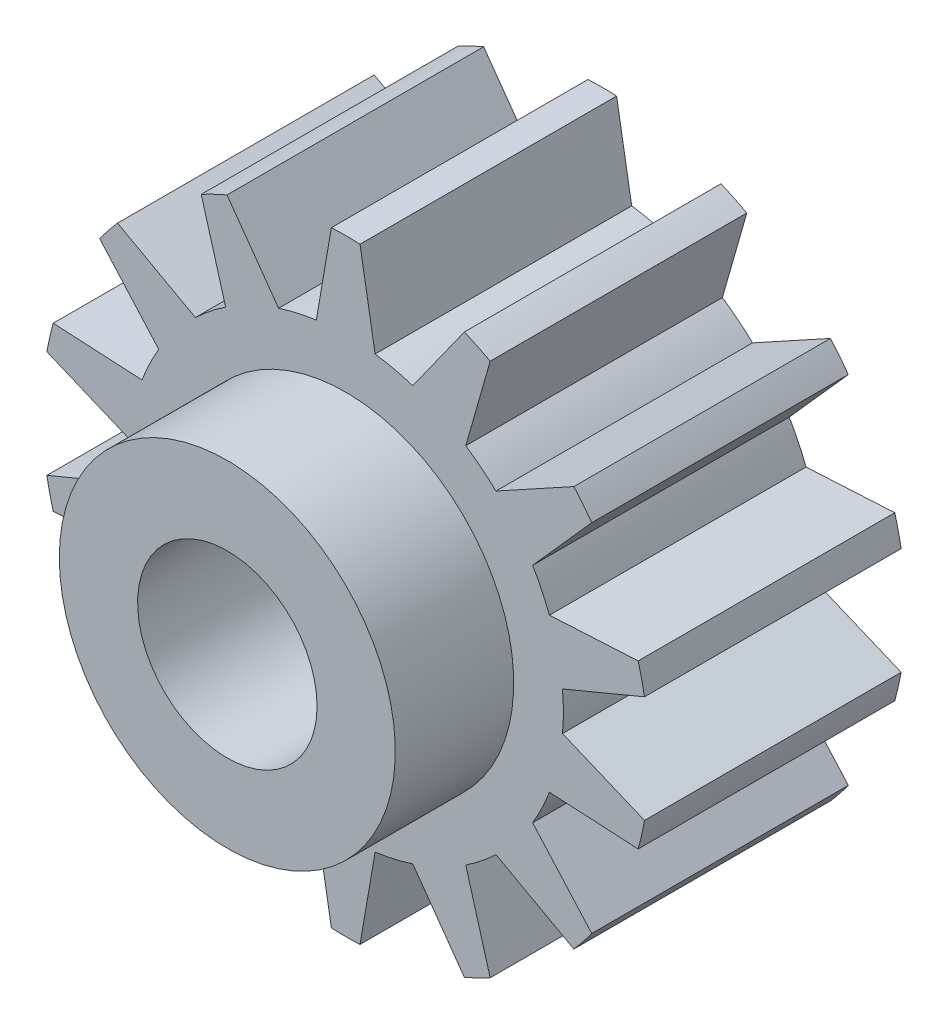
ISO-10303-21;
HEADER;
FILE_DESCRIPTION(('STEP AP214'),'2;1');
FILE_NAME('part.step','',(''),(''),'','','');
FILE_SCHEMA(('AUTOMOTIVE_DESIGN { 1 0 10303 214 1 1 1 1 }'));
ENDSEC;
DATA;
#1=APPLICATION_CONTEXT('core data for automotive mechanical design processes');
#2=APPLICATION_PROTOCOL_DEFINITION('international standard','automotive_design',2000,#1);
#3=PRODUCT_CONTEXT('',#1,'mechanical');
#4=PRODUCT('Part','Part','',(#3));
#5=PRODUCT_RELATED_PRODUCT_CATEGORY('part','',(#4));
#6=PRODUCT_DEFINITION_FORMATION('','',#4);
#7=PRODUCT_DEFINITION_CONTEXT('part definition',#1,'design');
#8=PRODUCT_DEFINITION('design','',#6,#7);
#9=PRODUCT_DEFINITION_SHAPE('','',#8);
#10=(LENGTH_UNIT() NAMED_UNIT(*) SI_UNIT(.MILLI.,.METRE.));
#11=(NAMED_UNIT(*) PLANE_ANGLE_UNIT() SI_UNIT($,.RADIAN.));
#12=(NAMED_UNIT(*) SI_UNIT($,.STERADIAN.) SOLID_ANGLE_UNIT());
#13=UNCERTAINTY_MEASURE_WITH_UNIT(LENGTH_MEASURE(1.E-05),#10,'distance_accuracy_value','');
#14=(GEOMETRIC_REPRESENTATION_CONTEXT(3) GLOBAL_UNCERTAINTY_ASSIGNED_CONTEXT((#13)) GLOBAL_UNIT_ASSIGNED_CONTEXT((#10,
#11,#12)) REPRESENTATION_CONTEXT('',''));
#15=CARTESIAN_POINT('',(0.,0.,0.));
#16=DIRECTION('',(0.,0.,1.));
#17=DIRECTION('',(1.,0.,0.));
#18=AXIS2_PLACEMENT_3D('',#15,#16,#17);
#19=CARTESIAN_POINT('',(0.,-1.38777878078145E-13,9.81999999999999));
#20=DIRECTION('',(0.,0.,-1.));
#21=DIRECTION('',(-1.,0.,0.));
#22=AXIS2_PLACEMENT_3D('',#19,#20,#21);
#23=CYLINDRICAL_SURFACE('',#22,2.35);
#24=CARTESIAN_POINT('',(0.,-1.38777878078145E-13,9.81999999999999));
#25=DIRECTION('',(0.,0.,1.));
#26=DIRECTION('',(1.,0.,0.));
#27=AXIS2_PLACEMENT_3D('',#24,#25,#26);
#28=CIRCLE('',#27,2.35);
#29=CARTESIAN_POINT('',(2.34999999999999,-1.32334811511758E-13,9.81999999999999));
#30=VERTEX_POINT('',#29);
#31=EDGE_CURVE('E413',#30,#30,#28,.T.);
#32=ORIENTED_EDGE('',*,*,#31,.T.);
#33=EDGE_LOOP('',(#32));
#34=FACE_BOUND('',#33,.T.);
#35=CARTESIAN_POINT('',(0.,0.,4.90000000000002));
#36=DIRECTION('',(0.,0.,-1.));
#37=DIRECTION('',(-1.,0.,0.));
#38=AXIS2_PLACEMENT_3D('',#35,#36,#37);
#39=CIRCLE('',#38,2.35);
#40=CARTESIAN_POINT('',(1.98997487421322,-1.25,4.90000000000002));
#41=VERTEX_POINT('',#40);
#42=CARTESIAN_POINT('',(-1.98997487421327,-1.24999999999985,4.90000000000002));
#43=VERTEX_POINT('',#42);
#44=EDGE_CURVE('E42',#41,#43,#39,.T.);
#45=ORIENTED_EDGE('',*,*,#44,.T.);
#46=DIRECTION('',(0.,0.,-1.));
#47=VECTOR('',#46,1.);
#48=CARTESIAN_POINT('',(-1.98997487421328,-1.25,9.81999999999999));
#49=LINE('',#48,#47);
#50=CARTESIAN_POINT('',(-1.98997487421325,-1.24999999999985,0.));
#51=VERTEX_POINT('',#50);
#52=EDGE_CURVE('E11',#43,#51,#49,.T.);
#53=ORIENTED_EDGE('',*,*,#52,.T.);
#54=CARTESIAN_POINT('',(0.,0.,0.));
#55=DIRECTION('',(0.,0.,1.));
#56=DIRECTION('',(1.,0.,0.));
#57=AXIS2_PLACEMENT_3D('',#54,#55,#56);
#58=CIRCLE('',#57,2.35);
#59=CARTESIAN_POINT('',(1.98997487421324,-1.24999999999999,0.));
#60=VERTEX_POINT('',#59);
#61=EDGE_CURVE('E411',#60,#51,#58,.T.);
#62=ORIENTED_EDGE('',*,*,#61,.F.);
#63=DIRECTION('',(0.,0.,-1.));
#64=VECTOR('',#63,1.);
#65=CARTESIAN_POINT('',(1.98997487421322,-1.25000000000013,9.81999999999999));
#66=LINE('',#65,#64);
#67=EDGE_CURVE('E398',#60,#41,#66,.F.);
#68=ORIENTED_EDGE('',*,*,#67,.T.);
#69=EDGE_LOOP('',(#45,#53,#62,#68));
#70=FACE_BOUND('',#69,.T.);
#71=ADVANCED_FACE('F34',(#34,#70),#23,.F.);
#72=CARTESIAN_POINT('',(0.,-1.38777878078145E-13,6.72));
#73=DIRECTION('',(0.,0.,1.));
#74=DIRECTION('',(1.,0.,0.));
#75=AXIS2_PLACEMENT_3D('',#72,#73,#74);
#76=PLANE('',#75);
#77=CARTESIAN_POINT('',(0.,-1.38777878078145E-13,6.72));
#78=DIRECTION('',(0.,0.,1.));
#79=DIRECTION('',(1.,0.,0.));
#80=AXIS2_PLACEMENT_3D('',#77,#78,#79);
#81=CIRCLE('',#80,5.7);
#82=CARTESIAN_POINT('',(-0.77,5.64775176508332,6.72));
#83=VERTEX_POINT('',#82);
#84=CARTESIAN_POINT('',(-1.75671635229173,5.42254070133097,6.72));
#85=VERTEX_POINT('',#84);
#86=EDGE_CURVE('E405',#83,#85,#81,.T.);
#87=ORIENTED_EDGE('',*,*,#86,.T.);
#88=DIRECTION('',(0.580512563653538,-0.814251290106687,0.));
#89=VECTOR('',#88,1.);
#90=CARTESIAN_POINT('',(-3.10766573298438,7.31743901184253,6.72));
#91=LINE('',#90,#89);
#92=CARTESIAN_POINT('',(-3.10766573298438,7.31743901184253,6.72));
#93=VERTEX_POINT('',#92);
#94=EDGE_CURVE('E437',#93,#85,#91,.T.);
#95=ORIENTED_EDGE('',*,*,#94,.F.);
#96=CARTESIAN_POINT('',(0.,-1.38777878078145E-13,6.72));
#97=DIRECTION('',(0.,0.,1.));
#98=DIRECTION('',(0.900969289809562,0.433882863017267,0.));
#99=AXIS2_PLACEMENT_3D('',#96,#97,#98);
#100=CIRCLE('',#99,7.95);
#101=CARTESIAN_POINT('',(-3.78339270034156,6.99202686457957,6.72));
#102=VERTEX_POINT('',#101);
#103=EDGE_CURVE('E425',#93,#102,#100,.T.);
#104=ORIENTED_EDGE('',*,*,#103,.T.);
#105=DIRECTION('',(0.274661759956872,-0.961540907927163,0.));
#106=VECTOR('',#105,1.);
#107=CARTESIAN_POINT('',(-3.78339270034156,6.99202686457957,6.72));
#108=LINE('',#107,#106);
#109=CARTESIAN_POINT('',(-3.14420905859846,4.75436109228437,6.72));
#110=VERTEX_POINT('',#109);
#111=EDGE_CURVE('E57',#102,#110,#108,.T.);
#112=ORIENTED_EDGE('',*,*,#111,.T.);
#113=CARTESIAN_POINT('',(-3.93549928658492,4.12332940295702,6.72));
#114=VERTEX_POINT('',#113);
#115=EDGE_CURVE('E779',#110,#114,#81,.T.);
#116=ORIENTED_EDGE('',*,*,#115,.T.);
#117=DIRECTION('',(0.876314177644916,-0.481740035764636,0.));
#118=VECTOR('',#117,1.);
#119=CARTESIAN_POINT('',(-5.97482826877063,5.24441866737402,6.72));
#120=LINE('',#119,#118);
#121=CARTESIAN_POINT('',(-5.97482826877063,5.24441866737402,6.72));
#122=VERTEX_POINT('',#121);
#123=EDGE_CURVE('E460',#122,#114,#120,.T.);
#124=ORIENTED_EDGE('',*,*,#123,.F.);
#125=CARTESIAN_POINT('',(0.,-1.38777878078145E-13,6.72));
#126=DIRECTION('',(0.,0.,1.));
#127=DIRECTION('',(0.62349050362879,0.781830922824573,0.));
#128=AXIS2_PLACEMENT_3D('',#125,#126,#127);
#129=CIRCLE('',#128,7.95);
#130=CARTESIAN_POINT('',(-6.44244614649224,4.65804547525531,6.72));
#131=VERTEX_POINT('',#130);
#132=EDGE_CURVE('E434',#122,#131,#129,.T.);
#133=ORIENTED_EDGE('',*,*,#132,.T.);
#134=DIRECTION('',(0.664658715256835,-0.747147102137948,0.));
#135=VECTOR('',#134,1.);
#136=CARTESIAN_POINT('',(-6.44244614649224,4.65804547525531,6.72));
#137=LINE('',#136,#135);
#138=CARTESIAN_POINT('',(-4.89567466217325,2.91930978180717,6.72));
#139=VERTEX_POINT('',#138);
#140=EDGE_CURVE('E458',#131,#139,#137,.T.);
#141=ORIENTED_EDGE('',*,*,#140,.T.);
#142=CARTESIAN_POINT('',(-5.33480806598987,2.00744187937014,6.72));
#143=VERTEX_POINT('',#142);
#144=EDGE_CURVE('E1014',#139,#143,#81,.T.);
#145=ORIENTED_EDGE('',*,*,#144,.T.);
#146=DIRECTION('',(0.998550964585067,-0.0538142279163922,0.));
#147=VECTOR('',#146,1.);
#148=CARTESIAN_POINT('',(-7.6586024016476,2.13267654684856,6.72));
#149=LINE('',#148,#147);
#150=CARTESIAN_POINT('',(-7.6586024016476,2.13267654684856,6.72));
#151=VERTEX_POINT('',#150);
#152=EDGE_CURVE('E485',#151,#143,#149,.T.);
#153=ORIENTED_EDGE('',*,*,#152,.F.);
#154=CARTESIAN_POINT('',(0.,-1.38777878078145E-13,6.72));
#155=DIRECTION('',(0.,0.,1.));
#156=DIRECTION('',(0.222521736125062,0.974927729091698,0.));
#157=AXIS2_PLACEMENT_3D('',#154,#155,#156);
#158=CIRCLE('',#157,7.95);
#159=CARTESIAN_POINT('',(-7.82549370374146,1.40148075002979,6.72));
#160=VERTEX_POINT('',#159);
#161=EDGE_CURVE('E455',#151,#160,#158,.T.);
#162=ORIENTED_EDGE('',*,*,#161,.T.);
#163=DIRECTION('',(0.923011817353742,-0.384771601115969,0.));
#164=VECTOR('',#163,1.);
#165=CARTESIAN_POINT('',(-7.82549370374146,1.40148075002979,6.72));
#166=LINE('',#165,#164);
#167=CARTESIAN_POINT('',(-5.67749153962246,0.506053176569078,6.72));
#168=VERTEX_POINT('',#167);
#169=EDGE_CURVE('E483',#160,#168,#166,.T.);
#170=ORIENTED_EDGE('',*,*,#169,.T.);
#171=CARTESIAN_POINT('',(-5.67749233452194,-0.506044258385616,6.72));
#172=VERTEX_POINT('',#171);
#173=EDGE_CURVE('E1015',#168,#172,#81,.T.);
#174=ORIENTED_EDGE('',*,*,#173,.T.);
#175=DIRECTION('',(0.923012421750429,0.384770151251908,0.));
#176=VECTOR('',#175,1.);
#177=CARTESIAN_POINT('',(-7.82549590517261,-1.40146845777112,6.72));
#178=LINE('',#177,#176);
#179=CARTESIAN_POINT('',(-7.82549590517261,-1.40146845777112,6.72));
#180=VERTEX_POINT('',#179);
#181=EDGE_CURVE('E510',#180,#172,#178,.T.);
#182=ORIENTED_EDGE('',*,*,#181,.F.);
#183=CARTESIAN_POINT('',(0.,-1.38777878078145E-13,6.72));
#184=DIRECTION('',(0.,0.,1.));
#185=DIRECTION('',(-0.222520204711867,0.974928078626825,0.));
#186=AXIS2_PLACEMENT_3D('',#183,#184,#185);
#187=CIRCLE('',#186,7.95);
#188=CARTESIAN_POINT('',(-7.6586057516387,-2.13266451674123,6.72));
#189=VERTEX_POINT('',#188);
#190=EDGE_CURVE('E480',#180,#189,#187,.T.);
#191=ORIENTED_EDGE('',*,*,#190,.T.);
#192=DIRECTION('',(0.998551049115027,0.0538126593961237,0.));
#193=VECTOR('',#192,1.);
#194=CARTESIAN_POINT('',(-7.6586057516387,-2.13266451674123,6.72));
#195=LINE('',#194,#193);
#196=CARTESIAN_POINT('',(-5.33481121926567,-2.00743349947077,6.72));
#197=VERTEX_POINT('',#196);
#198=EDGE_CURVE('E508',#189,#197,#195,.T.);
#199=ORIENTED_EDGE('',*,*,#198,.T.);
#200=CARTESIAN_POINT('',(-4.89567924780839,-2.91930209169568,6.72));
#201=VERTEX_POINT('',#200);
#202=EDGE_CURVE('E1018',#197,#201,#81,.T.);
#203=ORIENTED_EDGE('',*,*,#202,.T.);
#204=DIRECTION('',(0.664659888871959,0.747146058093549,0.));
#205=VECTOR('',#204,1.);
#206=CARTESIAN_POINT('',(-6.44245346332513,-4.65803535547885,6.72));
#207=LINE('',#206,#205);
#208=CARTESIAN_POINT('',(-6.44245346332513,-4.65803535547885,6.72));
#209=VERTEX_POINT('',#208);
#210=EDGE_CURVE('E535',#209,#201,#207,.T.);
#211=ORIENTED_EDGE('',*,*,#210,.F.);
#212=CARTESIAN_POINT('',(0.,-1.38777878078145E-13,6.72));
#213=DIRECTION('',(0.,0.,1.));
#214=DIRECTION('',(-0.62348927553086,0.781831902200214,0.));
#215=AXIS2_PLACEMENT_3D('',#212,#213,#214);
#216=CIRCLE('',#215,7.95);
#217=CARTESIAN_POINT('',(-5.97483650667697,-5.24440928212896,6.72));
#218=VERTEX_POINT('',#217);
#219=EDGE_CURVE('E505',#209,#218,#216,.T.);
#220=ORIENTED_EDGE('',*,*,#219,.T.);
#221=DIRECTION('',(0.876314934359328,0.481738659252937,0.));
#222=VECTOR('',#221,1.);
#223=CARTESIAN_POINT('',(-5.97483650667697,-5.24440928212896,6.72));
#224=LINE('',#223,#222);
#225=CARTESIAN_POINT('',(-3.93550576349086,-4.12332322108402,6.72));
#226=VERTEX_POINT('',#225);
#227=EDGE_CURVE('E533',#218,#226,#224,.T.);
#228=ORIENTED_EDGE('',*,*,#227,.T.);
#229=CARTESIAN_POINT('',(-3.14421652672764,-4.7543561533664,6.72));
#230=VERTEX_POINT('',#229);
#231=EDGE_CURVE('E1021',#226,#230,#81,.T.);
#232=ORIENTED_EDGE('',*,*,#231,.T.);
#233=DIRECTION('',(0.274663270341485,0.96154047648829,0.));
#234=VECTOR('',#233,1.);
#235=CARTESIAN_POINT('',(-3.78340368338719,-6.99202092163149,6.72));
#236=LINE('',#235,#234);
#237=CARTESIAN_POINT('',(-3.78340368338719,-6.99202092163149,6.72));
#238=VERTEX_POINT('',#237);
#239=EDGE_CURVE('E560',#238,#230,#236,.T.);
#240=ORIENTED_EDGE('',*,*,#239,.F.);
#241=CARTESIAN_POINT('',(0.,-1.38777878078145E-13,6.72));
#242=DIRECTION('',(0.,0.,1.));
#243=DIRECTION('',(-0.900968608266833,0.433884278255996,0.));
#244=AXIS2_PLACEMENT_3D('',#241,#242,#243);
#245=CIRCLE('',#244,7.95);
#246=CARTESIAN_POINT('',(-3.10767722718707,-7.31743413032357,6.72));
#247=VERTEX_POINT('',#246);
#248=EDGE_CURVE('E530',#238,#247,#245,.T.);
#249=ORIENTED_EDGE('',*,*,#248,.T.);
#250=DIRECTION('',(0.580513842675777,0.814250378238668,0.));
#251=VECTOR('',#250,1.);
#252=CARTESIAN_POINT('',(-3.10767722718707,-7.31743413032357,6.72));
#253=LINE('',#252,#251);
#254=CARTESIAN_POINT('',(-1.75672486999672,-5.42253794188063,6.72));
#255=VERTEX_POINT('',#254);
#256=EDGE_CURVE('E558',#247,#255,#253,.T.);
#257=ORIENTED_EDGE('',*,*,#256,.T.);
#258=CARTESIAN_POINT('',(-0.770002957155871,-5.64775136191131,6.72));
#259=VERTEX_POINT('',#258);
#260=EDGE_CURVE('E1024',#255,#259,#81,.T.);
#261=ORIENTED_EDGE('',*,*,#260,.T.);
#262=DIRECTION('',(-0.169733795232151,0.985489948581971,0.));
#263=VECTOR('',#262,1.);
#264=CARTESIAN_POINT('',(-0.375004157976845,-7.94115053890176,6.72));
#265=LINE('',#264,#263);
#266=CARTESIAN_POINT('',(-0.375004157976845,-7.94115053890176,6.72));
#267=VERTEX_POINT('',#266);
#268=EDGE_CURVE('E585',#267,#259,#265,.T.);
#269=ORIENTED_EDGE('',*,*,#268,.F.);
#270=CARTESIAN_POINT('',(0.,-1.38777878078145E-13,6.72));
#271=DIRECTION('',(0.,0.,1.));
#272=DIRECTION('',(-0.999999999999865,5.23598779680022E-07,0.));
#273=AXIS2_PLACEMENT_3D('',#270,#271,#272);
#274=CIRCLE('',#273,7.95);
#275=CARTESIAN_POINT('',(0.374995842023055,-7.94115093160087,6.72));
#276=VERTEX_POINT('',#275);
#277=EDGE_CURVE('E555',#267,#276,#274,.T.);
#278=ORIENTED_EDGE('',*,*,#277,.T.);
#279=DIRECTION('',(0.169734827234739,0.985489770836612,0.));
#280=VECTOR('',#279,1.);
#281=CARTESIAN_POINT('',(0.374995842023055,-7.94115093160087,6.72));
#282=LINE('',#281,#280);
#283=CARTESIAN_POINT('',(0.769997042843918,-5.64775216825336,6.72));
#284=VERTEX_POINT('',#283);
#285=EDGE_CURVE('E583',#276,#284,#282,.T.);
#286=ORIENTED_EDGE('',*,*,#285,.T.);
#287=CARTESIAN_POINT('',(1.75671919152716,-5.42253978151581,6.72));
#288=VERTEX_POINT('',#287);
#289=EDGE_CURVE('E1027',#284,#288,#81,.T.);
#290=ORIENTED_EDGE('',*,*,#289,.T.);
#291=DIRECTION('',(-0.580512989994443,0.814250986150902,0.));
#292=VECTOR('',#291,1.);
#293=CARTESIAN_POINT('',(3.10766956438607,-7.31743738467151,6.72));
#294=LINE('',#293,#292);
#295=CARTESIAN_POINT('',(3.10766956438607,-7.31743738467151,6.72));
#296=VERTEX_POINT('',#295);
#297=EDGE_CURVE('E610',#296,#288,#294,.T.);
#298=ORIENTED_EDGE('',*,*,#297,.F.);
#299=CARTESIAN_POINT('',(0.,-1.38777878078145E-13,6.72));
#300=DIRECTION('',(0.,0.,1.));
#301=DIRECTION('',(-0.900969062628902,-0.433883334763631,0.));
#302=AXIS2_PLACEMENT_3D('',#299,#300,#301);
#303=CIRCLE('',#302,7.95);
#304=CARTESIAN_POINT('',(3.78339636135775,-6.99202488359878,6.72));
#305=VERTEX_POINT('',#304);
#306=EDGE_CURVE('E580',#296,#305,#303,.T.);
#307=ORIENTED_EDGE('',*,*,#306,.T.);
#308=DIRECTION('',(-0.274662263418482,0.961540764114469,0.));
#309=VECTOR('',#308,1.);
#310=CARTESIAN_POINT('',(3.78339636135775,-6.99202488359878,6.72));
#311=LINE('',#310,#309);
#312=CARTESIAN_POINT('',(3.14421154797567,-4.75435944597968,6.72));
#313=VERTEX_POINT('',#312);
#314=EDGE_CURVE('E608',#305,#313,#311,.T.);
#315=ORIENTED_EDGE('',*,*,#314,.T.);
#316=CARTESIAN_POINT('',(3.93550144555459,-4.12332734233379,6.72));
#317=VERTEX_POINT('',#316);
#318=EDGE_CURVE('E1030',#313,#317,#81,.T.);
#319=ORIENTED_EDGE('',*,*,#318,.T.);
#320=DIRECTION('',(-0.876314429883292,0.481739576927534,0.));
#321=VECTOR('',#320,1.);
#322=CARTESIAN_POINT('',(5.97483101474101,-5.24441553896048,6.72));
#323=LINE('',#322,#321);
#324=CARTESIAN_POINT('',(5.97483101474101,-5.24441553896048,6.72));
#325=VERTEX_POINT('',#324);
#326=EDGE_CURVE('E635',#325,#317,#323,.T.);
#327=ORIENTED_EDGE('',*,*,#326,.F.);
#328=CARTESIAN_POINT('',(0.,-1.38777878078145E-13,6.72));
#329=DIRECTION('',(0.,0.,1.));
#330=DIRECTION('',(-0.623490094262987,-0.781831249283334,0.));
#331=AXIS2_PLACEMENT_3D('',#328,#329,#330);
#332=CIRCLE('',#331,7.95);
#333=CARTESIAN_POINT('',(6.44244858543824,-4.65804210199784,6.72));
#334=VERTEX_POINT('',#333);
#335=EDGE_CURVE('E605',#325,#334,#332,.T.);
#336=ORIENTED_EDGE('',*,*,#335,.T.);
#337=DIRECTION('',(-0.664659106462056,0.74714675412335,0.));
#338=VECTOR('',#337,1.);
#339=CARTESIAN_POINT('',(6.44244858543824,-4.65804210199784,6.72));
#340=LINE('',#339,#338);
#341=CARTESIAN_POINT('',(4.89567619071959,-2.91930721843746,6.72));
#342=VERTEX_POINT('',#341);
#343=EDGE_CURVE('E633',#334,#342,#340,.T.);
#344=ORIENTED_EDGE('',*,*,#343,.T.);
#345=CARTESIAN_POINT('',(5.33480911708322,-2.00743908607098,6.72));
#346=VERTEX_POINT('',#345);
#347=EDGE_CURVE('E1033',#342,#346,#81,.T.);
#348=ORIENTED_EDGE('',*,*,#347,.T.);
#349=DIRECTION('',(-0.998550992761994,0.0538137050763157,0.));
#350=VECTOR('',#349,1.);
#351=CARTESIAN_POINT('',(7.65860351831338,-2.13267253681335,6.72));
#352=LINE('',#351,#350);
#353=CARTESIAN_POINT('',(7.65860351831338,-2.13267253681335,6.72));
#354=VERTEX_POINT('',#353);
#355=EDGE_CURVE('E660',#354,#346,#352,.T.);
#356=ORIENTED_EDGE('',*,*,#355,.F.);
#357=CARTESIAN_POINT('',(0.,-1.38777878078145E-13,6.72));
#358=DIRECTION('',(0.,0.,1.));
#359=DIRECTION('',(-0.222521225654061,-0.974927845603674,0.));
#360=AXIS2_PLACEMENT_3D('',#357,#358,#359);
#361=CIRCLE('',#360,7.95);
#362=CARTESIAN_POINT('',(7.82549443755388,-1.4014766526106,6.72));
#363=VERTEX_POINT('',#362);
#364=EDGE_CURVE('E630',#354,#363,#361,.T.);
#365=ORIENTED_EDGE('',*,*,#364,.T.);
#366=DIRECTION('',(-0.923012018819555,0.384771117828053,0.));
#367=VECTOR('',#366,1.);
#368=CARTESIAN_POINT('',(7.82549443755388,-1.4014766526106,6.72));
#369=LINE('',#368,#367);
#370=CARTESIAN_POINT('',(5.67749180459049,-0.506050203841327,6.72));
#371=VERTEX_POINT('',#370);
#372=EDGE_CURVE('E658',#363,#371,#369,.T.);
#373=ORIENTED_EDGE('',*,*,#372,.T.);
#374=CARTESIAN_POINT('',(5.67749206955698,0.506047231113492,6.72));
#375=VERTEX_POINT('',#374);
#376=EDGE_CURVE('E1036',#371,#375,#81,.T.);
#377=ORIENTED_EDGE('',*,*,#376,.T.);
#378=DIRECTION('',(-0.923012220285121,-0.384770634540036,0.));
#379=VECTOR('',#378,1.);
#380=CARTESIAN_POINT('',(7.82549517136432,1.40147255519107,6.72));
#381=LINE('',#380,#379);
#382=CARTESIAN_POINT('',(7.82549517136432,1.40147255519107,6.72));
#383=VERTEX_POINT('',#382);
#384=EDGE_CURVE('E685',#383,#375,#381,.T.);
#385=ORIENTED_EDGE('',*,*,#384,.F.);
#386=CARTESIAN_POINT('',(0.,-1.38777878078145E-13,6.72));
#387=DIRECTION('',(0.,0.,1.));
#388=DIRECTION('',(0.222520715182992,-0.974927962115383,0.));
#389=AXIS2_PLACEMENT_3D('',#386,#387,#388);
#390=CIRCLE('',#389,7.95);
#391=CARTESIAN_POINT('',(7.65860463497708,2.13266852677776,6.72));
#392=VERTEX_POINT('',#391);
#393=EDGE_CURVE('E655',#383,#392,#390,.T.);
#394=ORIENTED_EDGE('',*,*,#393,.T.);
#395=DIRECTION('',(-0.998551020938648,-0.0538131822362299,0.));
#396=VECTOR('',#395,1.);
#397=CARTESIAN_POINT('',(7.65860463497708,2.13266852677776,6.72));
#398=LINE('',#397,#396);
#399=CARTESIAN_POINT('',(5.33481016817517,2.00743629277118,6.72));
#400=VERTEX_POINT('',#399);
#401=EDGE_CURVE('E683',#392,#400,#398,.T.);
#402=ORIENTED_EDGE('',*,*,#401,.T.);
#403=CARTESIAN_POINT('',(4.89567771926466,2.919304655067,6.72));
#404=VERTEX_POINT('',#403);
#405=EDGE_CURVE('E1039',#400,#404,#81,.T.);
#406=ORIENTED_EDGE('',*,*,#405,.T.);
#407=DIRECTION('',(-0.664659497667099,-0.747146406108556,0.));
#408=VECTOR('',#407,1.);
#409=CARTESIAN_POINT('',(6.44245102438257,4.65803872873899,6.72));
#410=LINE('',#409,#408);
#411=CARTESIAN_POINT('',(6.44245102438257,4.65803872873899,6.72));
#412=VERTEX_POINT('',#411);
#413=EDGE_CURVE('E710',#412,#404,#410,.T.);
#414=ORIENTED_EDGE('',*,*,#413,.F.);
#415=CARTESIAN_POINT('',(0.,-1.38777878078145E-13,6.72));
#416=DIRECTION('',(0.,0.,1.));
#417=DIRECTION('',(0.623489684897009,-0.781831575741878,0.));
#418=AXIS2_PLACEMENT_3D('',#415,#416,#417);
#419=CIRCLE('',#418,7.95);
#420=CARTESIAN_POINT('',(5.9748337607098,5.2444124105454,6.72));
#421=VERTEX_POINT('',#420);
#422=EDGE_CURVE('E680',#412,#421,#419,.T.);
#423=ORIENTED_EDGE('',*,*,#422,.T.);
#424=DIRECTION('',(-0.87631468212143,-0.481739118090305,0.));
#425=VECTOR('',#424,1.);
#426=CARTESIAN_POINT('',(5.9748337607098,5.2444124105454,6.72));
#427=LINE('',#426,#425);
#428=CARTESIAN_POINT('',(3.93550360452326,4.12332528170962,6.72));
#429=VERTEX_POINT('',#428);
#430=EDGE_CURVE('E708',#421,#429,#427,.T.);
#431=ORIENTED_EDGE('',*,*,#430,.T.);
#432=CARTESIAN_POINT('',(3.14421403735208,4.75435779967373,6.72));
#433=VERTEX_POINT('',#432);
#434=EDGE_CURVE('E1042',#429,#433,#81,.T.);
#435=ORIENTED_EDGE('',*,*,#434,.T.);
#436=DIRECTION('',(-0.274662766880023,-0.961540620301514,0.));
#437=VECTOR('',#436,1.);
#438=CARTESIAN_POINT('',(3.78340002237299,6.99202290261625,6.72));
#439=LINE('',#438,#437);
#440=CARTESIAN_POINT('',(3.78340002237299,6.99202290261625,6.72));
#441=VERTEX_POINT('',#440);
#442=EDGE_CURVE('E735',#441,#433,#439,.T.);
#443=ORIENTED_EDGE('',*,*,#442,.F.);
#444=CARTESIAN_POINT('',(0.,-1.38777878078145E-13,6.72));
#445=DIRECTION('',(0.,0.,1.));
#446=DIRECTION('',(0.900968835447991,-0.43388380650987,0.));
#447=AXIS2_PLACEMENT_3D('',#444,#445,#446);
#448=CIRCLE('',#447,7.95);
#449=CARTESIAN_POINT('',(3.107673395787,7.31743575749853,6.72));
#450=VERTEX_POINT('',#449);
#451=EDGE_CURVE('E705',#441,#450,#448,.T.);
#452=ORIENTED_EDGE('',*,*,#451,.T.);
#453=DIRECTION('',(-0.580513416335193,-0.814250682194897,0.));
#454=VECTOR('',#453,1.);
#455=CARTESIAN_POINT('',(3.107673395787,7.31743575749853,6.72));
#456=LINE('',#455,#454);
#457=CARTESIAN_POINT('',(1.75672203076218,5.42253886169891,6.72));
#458=VERTEX_POINT('',#457);
#459=EDGE_CURVE('E733',#450,#458,#456,.T.);
#460=ORIENTED_EDGE('',*,*,#459,.T.);
#461=CARTESIAN_POINT('',(0.77,5.64775176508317,6.72));
#462=VERTEX_POINT('',#461);
#463=EDGE_CURVE('E776',#458,#462,#81,.T.);
#464=ORIENTED_EDGE('',*,*,#463,.T.);
#465=DIRECTION('',(0.169734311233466,-0.985489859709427,0.));
#466=VECTOR('',#465,1.);
#467=CARTESIAN_POINT('',(0.375000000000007,7.94115073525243,6.72));
#468=LINE('',#467,#466);
#469=CARTESIAN_POINT('',(0.375000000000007,7.94115073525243,6.72));
#470=VERTEX_POINT('',#469);
#471=EDGE_CURVE('E761',#470,#462,#468,.T.);
#472=ORIENTED_EDGE('',*,*,#471,.F.);
#473=CARTESIAN_POINT('',(0.,-1.38777878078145E-13,6.72));
#474=DIRECTION('',(0.,0.,1.));
#475=DIRECTION('',(1.,0.,0.));
#476=AXIS2_PLACEMENT_3D('',#473,#474,#475);
#477=CIRCLE('',#476,7.95);
#478=CARTESIAN_POINT('',(-0.374999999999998,7.94115073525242,6.72));
#479=VERTEX_POINT('',#478);
#480=EDGE_CURVE('E730',#470,#479,#477,.T.);
#481=ORIENTED_EDGE('',*,*,#480,.T.);
#482=DIRECTION('',(-0.169734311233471,-0.985489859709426,0.));
#483=VECTOR('',#482,1.);
#484=CARTESIAN_POINT('',(-0.374999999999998,7.94115073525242,6.72));
#485=LINE('',#484,#483);
#486=EDGE_CURVE('E758',#479,#83,#485,.T.);
#487=ORIENTED_EDGE('',*,*,#486,.T.);
#488=EDGE_LOOP('',(#87,#95,#104,#112,#116,#124,#133,#141,#145,#153,#162,#170,#174,#182,#191,
#199,#203,#211,#220,#228,#232,#240,#249,#257,#261,#269,#278,#286,#290,#298,#307,#315,#319,#327,
#336,#344,#348,#356,#365,#373,#377,#385,#394,#402,#406,#414,#423,#431,#435,#443,#452,#460,#464,
#472,#481,#487));
#489=FACE_BOUND('',#488,.T.);
#490=CARTESIAN_POINT('',(0.,-1.38777878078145E-13,6.72));
#491=DIRECTION('',(0.,0.,1.));
#492=DIRECTION('',(1.,0.,0.));
#493=AXIS2_PLACEMENT_3D('',#490,#491,#492);
#494=CIRCLE('',#493,4.4);
#495=CARTESIAN_POINT('',(-4.40000000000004,-1.43269771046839E-13,6.71999999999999));
#496=VERTEX_POINT('',#495);
#497=EDGE_CURVE('E416',#496,#496,#494,.T.);
#498=ORIENTED_EDGE('',*,*,#497,.F.);
#499=EDGE_LOOP('',(#498));
#500=FACE_BOUND('',#499,.T.);
#501=ADVANCED_FACE('F794',(#489,#500),#76,.T.);
#502=CARTESIAN_POINT('',(0.,-1.38777878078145E-13,6.72));
#503=DIRECTION('',(0.,0.,-1.));
#504=DIRECTION('',(-1.,0.,0.));
#505=AXIS2_PLACEMENT_3D('',#502,#503,#504);
#506=CYLINDRICAL_SURFACE('',#505,5.7);
#507=DIRECTION('',(0.,0.,1.));
#508=VECTOR('',#507,1.);
#509=CARTESIAN_POINT('',(-1.75671635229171,5.42254070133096,-3.26753507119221));
#510=LINE('',#509,#508);
#511=CARTESIAN_POINT('',(-1.75671635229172,5.42254070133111,0.));
#512=VERTEX_POINT('',#511);
#513=EDGE_CURVE('E441',#512,#85,#510,.T.);
#514=ORIENTED_EDGE('',*,*,#513,.T.);
#515=ORIENTED_EDGE('',*,*,#86,.F.);
#516=DIRECTION('',(0.,0.,1.));
#517=VECTOR('',#516,1.);
#518=CARTESIAN_POINT('',(-0.769999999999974,5.64775176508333,-2.7698279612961));
#519=LINE('',#518,#517);
#520=CARTESIAN_POINT('',(-0.769999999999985,5.64775176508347,0.));
#521=VERTEX_POINT('',#520);
#522=EDGE_CURVE('E769',#521,#83,#519,.T.);
#523=ORIENTED_EDGE('',*,*,#522,.F.);
#524=CARTESIAN_POINT('',(0.,0.,0.));
#525=DIRECTION('',(0.,0.,1.));
#526=DIRECTION('',(1.,0.,0.));
#527=AXIS2_PLACEMENT_3D('',#524,#525,#526);
#528=CIRCLE('',#527,5.7);
#529=EDGE_CURVE('E773',#521,#512,#528,.T.);
#530=ORIENTED_EDGE('',*,*,#529,.T.);
#531=EDGE_LOOP('',(#514,#515,#523,#530));
#532=FACE_BOUND('',#531,.T.);
#533=ADVANCED_FACE('F800',(#532),#506,.T.);
#534=ORIENTED_EDGE('',*,*,#115,.F.);
#535=DIRECTION('',(0.,0.,1.));
#536=VECTOR('',#535,1.);
#537=CARTESIAN_POINT('',(-3.14420905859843,4.75436109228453,-3.26753507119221));
#538=LINE('',#537,#536);
#539=CARTESIAN_POINT('',(-3.14420905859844,4.75436109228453,0.));
#540=VERTEX_POINT('',#539);
#541=EDGE_CURVE('E444',#540,#110,#538,.T.);
#542=ORIENTED_EDGE('',*,*,#541,.F.);
#543=CARTESIAN_POINT('',(-3.9354992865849,4.12332940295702,0.));
#544=VERTEX_POINT('',#543);
#545=EDGE_CURVE('E777',#540,#544,#528,.T.);
#546=ORIENTED_EDGE('',*,*,#545,.T.);
#547=DIRECTION('',(0.,0.,1.));
#548=VECTOR('',#547,1.);
#549=CARTESIAN_POINT('',(-3.93549928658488,4.12332940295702,-3.4191978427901));
#550=LINE('',#549,#548);
#551=EDGE_CURVE('E465',#544,#114,#550,.T.);
#552=ORIENTED_EDGE('',*,*,#551,.T.);
#553=EDGE_LOOP('',(#534,#542,#546,#552));
#554=FACE_BOUND('',#553,.T.);
#555=ADVANCED_FACE('F986',(#554),#506,.T.);
#556=ORIENTED_EDGE('',*,*,#144,.F.);
#557=DIRECTION('',(0.,0.,1.));
#558=VECTOR('',#557,1.);
#559=CARTESIAN_POINT('',(-4.89567466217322,2.91930978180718,-3.4191978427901));
#560=LINE('',#559,#558);
#561=CARTESIAN_POINT('',(-4.89567466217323,2.91930978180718,0.));
#562=VERTEX_POINT('',#561);
#563=EDGE_CURVE('E468',#562,#139,#560,.T.);
#564=ORIENTED_EDGE('',*,*,#563,.F.);
#565=CARTESIAN_POINT('',(-5.33480806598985,2.00744187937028,0.));
#566=VERTEX_POINT('',#565);
#567=EDGE_CURVE('E1097',#562,#566,#528,.T.);
#568=ORIENTED_EDGE('',*,*,#567,.T.);
#569=DIRECTION('',(0.,0.,1.));
#570=VECTOR('',#569,1.);
#571=CARTESIAN_POINT('',(-5.33480806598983,2.00744187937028,-2.97479722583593));
#572=LINE('',#571,#570);
#573=EDGE_CURVE('E490',#566,#143,#572,.T.);
#574=ORIENTED_EDGE('',*,*,#573,.T.);
#575=EDGE_LOOP('',(#556,#564,#568,#574));
#576=FACE_BOUND('',#575,.T.);
#577=ADVANCED_FACE('F991',(#576),#506,.T.);
#578=ORIENTED_EDGE('',*,*,#173,.F.);
#579=DIRECTION('',(0.,0.,1.));
#580=VECTOR('',#579,1.);
#581=CARTESIAN_POINT('',(-5.67749153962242,0.506053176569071,-2.97479722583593));
#582=LINE('',#581,#580);
#583=CARTESIAN_POINT('',(-5.67749153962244,0.506053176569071,0.));
#584=VERTEX_POINT('',#583);
#585=EDGE_CURVE('E493',#584,#168,#582,.T.);
#586=ORIENTED_EDGE('',*,*,#585,.F.);
#587=CARTESIAN_POINT('',(-5.67749233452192,-0.506044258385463,0.));
#588=VERTEX_POINT('',#587);
#589=EDGE_CURVE('E1092',#584,#588,#528,.T.);
#590=ORIENTED_EDGE('',*,*,#589,.T.);
#591=DIRECTION('',(0.,0.,1.));
#592=VECTOR('',#591,1.);
#593=CARTESIAN_POINT('',(-5.6774923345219,-0.506044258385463,-2.97479472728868));
#594=LINE('',#593,#592);
#595=EDGE_CURVE('E515',#588,#172,#594,.T.);
#596=ORIENTED_EDGE('',*,*,#595,.T.);
#597=EDGE_LOOP('',(#578,#586,#590,#596));
#598=FACE_BOUND('',#597,.T.);
#599=ADVANCED_FACE('F1118',(#598),#506,.T.);
#600=ORIENTED_EDGE('',*,*,#202,.F.);
#601=DIRECTION('',(0.,0.,1.));
#602=VECTOR('',#601,1.);
#603=CARTESIAN_POINT('',(-5.33481121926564,-2.00743349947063,-2.97479472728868));
#604=LINE('',#603,#602);
#605=CARTESIAN_POINT('',(-5.33481121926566,-2.00743349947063,0.));
#606=VERTEX_POINT('',#605);
#607=EDGE_CURVE('E518',#606,#197,#604,.T.);
#608=ORIENTED_EDGE('',*,*,#607,.F.);
#609=CARTESIAN_POINT('',(-4.89567924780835,-2.91930209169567,0.));
#610=VERTEX_POINT('',#609);
#611=EDGE_CURVE('E1087',#606,#610,#528,.T.);
#612=ORIENTED_EDGE('',*,*,#611,.T.);
#613=DIRECTION('',(0.,0.,1.));
#614=VECTOR('',#613,1.);
#615=CARTESIAN_POINT('',(-4.89567924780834,-2.91930209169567,-3.41919730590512));
#616=LINE('',#615,#614);
#617=EDGE_CURVE('E540',#610,#201,#616,.T.);
#618=ORIENTED_EDGE('',*,*,#617,.T.);
#619=EDGE_LOOP('',(#600,#608,#612,#618));
#620=FACE_BOUND('',#619,.T.);
#621=ADVANCED_FACE('F1125',(#620),#506,.T.);
#622=ORIENTED_EDGE('',*,*,#231,.F.);
#623=DIRECTION('',(0.,0.,1.));
#624=VECTOR('',#623,1.);
#625=CARTESIAN_POINT('',(-3.93550576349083,-4.123323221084,-3.41919730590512));
#626=LINE('',#625,#624);
#627=CARTESIAN_POINT('',(-3.93550576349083,-4.12332322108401,0.));
#628=VERTEX_POINT('',#627);
#629=EDGE_CURVE('E543',#628,#226,#626,.T.);
#630=ORIENTED_EDGE('',*,*,#629,.F.);
#631=CARTESIAN_POINT('',(-3.14421652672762,-4.75435615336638,0.));
#632=VERTEX_POINT('',#631);
#633=EDGE_CURVE('E1082',#628,#632,#528,.T.);
#634=ORIENTED_EDGE('',*,*,#633,.T.);
#635=DIRECTION('',(0.,0.,1.));
#636=VECTOR('',#635,1.);
#637=CARTESIAN_POINT('',(-3.14421652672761,-4.75435615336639,-3.26753664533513));
#638=LINE('',#637,#636);
#639=EDGE_CURVE('E565',#632,#230,#638,.T.);
#640=ORIENTED_EDGE('',*,*,#639,.T.);
#641=EDGE_LOOP('',(#622,#630,#634,#640));
#642=FACE_BOUND('',#641,.T.);
#643=ADVANCED_FACE('F1132',(#642),#506,.T.);
#644=ORIENTED_EDGE('',*,*,#260,.F.);
#645=DIRECTION('',(0.,0.,1.));
#646=VECTOR('',#645,1.);
#647=CARTESIAN_POINT('',(-1.75672486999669,-5.42253794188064,-3.26753664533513));
#648=LINE('',#647,#646);
#649=CARTESIAN_POINT('',(-1.7567248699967,-5.42253794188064,0.));
#650=VERTEX_POINT('',#649);
#651=EDGE_CURVE('E568',#650,#255,#648,.T.);
#652=ORIENTED_EDGE('',*,*,#651,.F.);
#653=CARTESIAN_POINT('',(-0.770002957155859,-5.64775136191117,0.));
#654=VERTEX_POINT('',#653);
#655=EDGE_CURVE('E1077',#650,#654,#528,.T.);
#656=ORIENTED_EDGE('',*,*,#655,.T.);
#657=DIRECTION('',(0.,0.,1.));
#658=VECTOR('',#657,1.);
#659=CARTESIAN_POINT('',(-0.770002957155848,-5.64775136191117,-2.76982829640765));
#660=LINE('',#659,#658);
#661=EDGE_CURVE('E590',#654,#259,#660,.T.);
#662=ORIENTED_EDGE('',*,*,#661,.T.);
#663=EDGE_LOOP('',(#644,#652,#656,#662));
#664=FACE_BOUND('',#663,.T.);
#665=ADVANCED_FACE('F1139',(#664),#506,.T.);
#666=ORIENTED_EDGE('',*,*,#289,.F.);
#667=DIRECTION('',(0.,0.,1.));
#668=VECTOR('',#667,1.);
#669=CARTESIAN_POINT('',(0.769997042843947,-5.6477521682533,-2.76982829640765));
#670=LINE('',#669,#668);
#671=CARTESIAN_POINT('',(0.769997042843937,-5.6477521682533,0.));
#672=VERTEX_POINT('',#671);
#673=EDGE_CURVE('E593',#672,#284,#670,.T.);
#674=ORIENTED_EDGE('',*,*,#673,.F.);
#675=CARTESIAN_POINT('',(1.75671919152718,-5.42253978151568,0.));
#676=VERTEX_POINT('',#675);
#677=EDGE_CURVE('E1072',#672,#676,#528,.T.);
#678=ORIENTED_EDGE('',*,*,#677,.T.);
#679=DIRECTION('',(0.,0.,1.));
#680=VECTOR('',#679,1.);
#681=CARTESIAN_POINT('',(1.75671919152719,-5.42253978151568,-3.26753559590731));
#682=LINE('',#681,#680);
#683=EDGE_CURVE('E615',#676,#288,#682,.T.);
#684=ORIENTED_EDGE('',*,*,#683,.T.);
#685=EDGE_LOOP('',(#666,#674,#678,#684));
#686=FACE_BOUND('',#685,.T.);
#687=ADVANCED_FACE('F1146',(#686),#506,.T.);
#688=ORIENTED_EDGE('',*,*,#318,.F.);
#689=DIRECTION('',(0.,0.,1.));
#690=VECTOR('',#689,1.);
#691=CARTESIAN_POINT('',(3.1442115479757,-4.75435944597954,-3.26753559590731));
#692=LINE('',#691,#690);
#693=CARTESIAN_POINT('',(3.14421154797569,-4.75435944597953,0.));
#694=VERTEX_POINT('',#693);
#695=EDGE_CURVE('E618',#694,#313,#692,.T.);
#696=ORIENTED_EDGE('',*,*,#695,.F.);
#697=CARTESIAN_POINT('',(3.93550144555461,-4.12332734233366,0.));
#698=VERTEX_POINT('',#697);
#699=EDGE_CURVE('E1067',#694,#698,#528,.T.);
#700=ORIENTED_EDGE('',*,*,#699,.T.);
#701=DIRECTION('',(0.,0.,1.));
#702=VECTOR('',#701,1.);
#703=CARTESIAN_POINT('',(3.93550144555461,-4.1233273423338,-3.41919766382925));
#704=LINE('',#703,#702);
#705=EDGE_CURVE('E640',#698,#317,#704,.T.);
#706=ORIENTED_EDGE('',*,*,#705,.T.);
#707=EDGE_LOOP('',(#688,#696,#700,#706));
#708=FACE_BOUND('',#707,.T.);
#709=ADVANCED_FACE('F1153',(#708),#506,.T.);
#710=ORIENTED_EDGE('',*,*,#347,.F.);
#711=DIRECTION('',(0.,0.,1.));
#712=VECTOR('',#711,1.);
#713=CARTESIAN_POINT('',(4.89567619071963,-2.91930721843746,-3.41919766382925));
#714=LINE('',#713,#712);
#715=CARTESIAN_POINT('',(4.89567619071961,-2.91930721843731,0.));
#716=VERTEX_POINT('',#715);
#717=EDGE_CURVE('E643',#716,#342,#714,.T.);
#718=ORIENTED_EDGE('',*,*,#717,.F.);
#719=CARTESIAN_POINT('',(5.33480911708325,-2.00743908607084,0.));
#720=VERTEX_POINT('',#719);
#721=EDGE_CURVE('E1062',#716,#720,#528,.T.);
#722=ORIENTED_EDGE('',*,*,#721,.T.);
#723=DIRECTION('',(0.,0.,1.));
#724=VECTOR('',#723,1.);
#725=CARTESIAN_POINT('',(5.33480911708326,-2.00743908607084,-2.97479639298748));
#726=LINE('',#725,#724);
#727=EDGE_CURVE('E665',#720,#346,#726,.T.);
#728=ORIENTED_EDGE('',*,*,#727,.T.);
#729=EDGE_LOOP('',(#710,#718,#722,#728));
#730=FACE_BOUND('',#729,.T.);
#731=ADVANCED_FACE('F1160',(#730),#506,.T.);
#732=ORIENTED_EDGE('',*,*,#376,.F.);
#733=DIRECTION('',(0.,0.,1.));
#734=VECTOR('',#733,1.);
#735=CARTESIAN_POINT('',(5.67749180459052,-0.506050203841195,-2.97479639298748));
#736=LINE('',#735,#734);
#737=CARTESIAN_POINT('',(5.6774918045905,-0.506050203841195,0.));
#738=VERTEX_POINT('',#737);
#739=EDGE_CURVE('E668',#738,#371,#736,.T.);
#740=ORIENTED_EDGE('',*,*,#739,.F.);
#741=CARTESIAN_POINT('',(5.677492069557,0.506047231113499,0.));
#742=VERTEX_POINT('',#741);
#743=EDGE_CURVE('E1057',#738,#742,#528,.T.);
#744=ORIENTED_EDGE('',*,*,#743,.T.);
#745=DIRECTION('',(0.,0.,1.));
#746=VECTOR('',#745,1.);
#747=CARTESIAN_POINT('',(5.67749206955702,0.506047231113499,-2.97479556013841));
#748=LINE('',#747,#746);
#749=EDGE_CURVE('E690',#742,#375,#748,.T.);
#750=ORIENTED_EDGE('',*,*,#749,.T.);
#751=EDGE_LOOP('',(#732,#740,#744,#750));
#752=FACE_BOUND('',#751,.T.);
#753=ADVANCED_FACE('F1167',(#752),#506,.T.);
#754=ORIENTED_EDGE('',*,*,#405,.F.);
#755=DIRECTION('',(0.,0.,1.));
#756=VECTOR('',#755,1.);
#757=CARTESIAN_POINT('',(5.3348101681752,2.00743629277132,-2.97479556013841));
#758=LINE('',#757,#756);
#759=CARTESIAN_POINT('',(5.33481016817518,2.00743629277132,0.));
#760=VERTEX_POINT('',#759);
#761=EDGE_CURVE('E693',#760,#400,#758,.T.);
#762=ORIENTED_EDGE('',*,*,#761,.F.);
#763=CARTESIAN_POINT('',(4.89567771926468,2.91930465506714,0.));
#764=VERTEX_POINT('',#763);
#765=EDGE_CURVE('E1053',#760,#764,#528,.T.);
#766=ORIENTED_EDGE('',*,*,#765,.T.);
#767=DIRECTION('',(0.,0.,1.));
#768=VECTOR('',#767,1.);
#769=CARTESIAN_POINT('',(4.89567771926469,2.91930465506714,-3.41919748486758));
#770=LINE('',#769,#768);
#771=EDGE_CURVE('E715',#764,#404,#770,.T.);
#772=ORIENTED_EDGE('',*,*,#771,.T.);
#773=EDGE_LOOP('',(#754,#762,#766,#772));
#774=FACE_BOUND('',#773,.T.);
#775=ADVANCED_FACE('F982',(#774),#506,.T.);
#776=ORIENTED_EDGE('',*,*,#434,.F.);
#777=DIRECTION('',(0.,0.,1.));
#778=VECTOR('',#777,1.);
#779=CARTESIAN_POINT('',(3.9355036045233,4.12332528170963,-3.41919748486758));
#780=LINE('',#779,#778);
#781=CARTESIAN_POINT('',(3.93550360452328,4.12332528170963,0.));
#782=VERTEX_POINT('',#781);
#783=EDGE_CURVE('E718',#782,#429,#780,.T.);
#784=ORIENTED_EDGE('',*,*,#783,.F.);
#785=CARTESIAN_POINT('',(3.1442140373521,4.75435779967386,0.));
#786=VERTEX_POINT('',#785);
#787=EDGE_CURVE('E1052',#782,#786,#528,.T.);
#788=ORIENTED_EDGE('',*,*,#787,.T.);
#789=DIRECTION('',(0.,0.,1.));
#790=VECTOR('',#789,1.);
#791=CARTESIAN_POINT('',(3.14421403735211,4.75435779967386,-3.26753612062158));
#792=LINE('',#791,#790);
#793=EDGE_CURVE('E740',#786,#433,#792,.T.);
#794=ORIENTED_EDGE('',*,*,#793,.T.);
#795=EDGE_LOOP('',(#776,#784,#788,#794));
#796=FACE_BOUND('',#795,.T.);
#797=ADVANCED_FACE('F977',(#796),#506,.T.);
#798=ORIENTED_EDGE('',*,*,#463,.F.);
#799=DIRECTION('',(0.,0.,1.));
#800=VECTOR('',#799,1.);
#801=CARTESIAN_POINT('',(1.75672203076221,5.4225388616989,-3.26753612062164));
#802=LINE('',#801,#800);
#803=CARTESIAN_POINT('',(1.7567220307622,5.42253886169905,0.));
#804=VERTEX_POINT('',#803);
#805=EDGE_CURVE('E743',#804,#458,#802,.T.);
#806=ORIENTED_EDGE('',*,*,#805,.F.);
#807=CARTESIAN_POINT('',(0.770000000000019,5.64775176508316,0.));
#808=VERTEX_POINT('',#807);
#809=EDGE_CURVE('E755',#804,#808,#528,.T.);
#810=ORIENTED_EDGE('',*,*,#809,.T.);
#811=DIRECTION('',(0.,0.,1.));
#812=VECTOR('',#811,1.);
#813=CARTESIAN_POINT('',(0.770000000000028,5.64775176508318,-2.7698279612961));
#814=LINE('',#813,#812);
#815=EDGE_CURVE('E766',#808,#462,#814,.T.);
#816=ORIENTED_EDGE('',*,*,#815,.T.);
#817=EDGE_LOOP('',(#798,#806,#810,#816));
#818=FACE_BOUND('',#817,.T.);
#819=ADVANCED_FACE('F36',(#818),#506,.T.);
#820=CARTESIAN_POINT('',(0.,0.,0.));
#821=DIRECTION('',(0.,0.,1.));
#822=DIRECTION('',(1.,0.,0.));
#823=AXIS2_PLACEMENT_3D('',#820,#821,#822);
#824=PLANE('',#823);
#825=ORIENTED_EDGE('',*,*,#61,.T.);
#826=DIRECTION('',(-1.,0.,0.));
#827=VECTOR('',#826,1.);
#828=CARTESIAN_POINT('',(3.10805405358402,-1.24999999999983,0.));
#829=LINE('',#828,#827);
#830=EDGE_CURVE('E401',#60,#51,#829,.T.);
#831=ORIENTED_EDGE('',*,*,#830,.F.);
#832=EDGE_LOOP('',(#825,#831));
#833=FACE_BOUND('',#832,.T.);
#834=ORIENTED_EDGE('',*,*,#529,.F.);
#835=DIRECTION('',(0.169734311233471,0.985489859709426,0.));
#836=VECTOR('',#835,1.);
#837=CARTESIAN_POINT('',(-0.374999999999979,7.94115073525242,0.));
#838=LINE('',#837,#836);
#839=CARTESIAN_POINT('',(-0.374999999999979,7.94115073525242,0.));
#840=VERTEX_POINT('',#839);
#841=EDGE_CURVE('E753',#521,#840,#838,.T.);
#842=ORIENTED_EDGE('',*,*,#841,.T.);
#843=CARTESIAN_POINT('',(0.,0.,0.));
#844=DIRECTION('',(0.,0.,1.));
#845=DIRECTION('',(1.,0.,0.));
#846=AXIS2_PLACEMENT_3D('',#843,#844,#845);
#847=CIRCLE('',#846,7.95);
#848=CARTESIAN_POINT('',(0.375000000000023,7.94115073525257,0.));
#849=VERTEX_POINT('',#848);
#850=EDGE_CURVE('E750',#840,#849,#847,.F.);
#851=ORIENTED_EDGE('',*,*,#850,.T.);
#852=DIRECTION('',(-0.169734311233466,0.985489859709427,0.));
#853=VECTOR('',#852,1.);
#854=CARTESIAN_POINT('',(0.375000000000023,7.94115073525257,0.));
#855=LINE('',#854,#853);
#856=EDGE_CURVE('E747',#808,#849,#855,.T.);
#857=ORIENTED_EDGE('',*,*,#856,.F.);
#858=ORIENTED_EDGE('',*,*,#809,.F.);
#859=DIRECTION('',(0.580513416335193,0.814250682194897,0.));
#860=VECTOR('',#859,1.);
#861=CARTESIAN_POINT('',(3.10767339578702,7.31743575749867,0.));
#862=LINE('',#861,#860);
#863=CARTESIAN_POINT('',(3.10767339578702,7.31743575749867,0.));
#864=VERTEX_POINT('',#863);
#865=EDGE_CURVE('E728',#804,#864,#862,.T.);
#866=ORIENTED_EDGE('',*,*,#865,.T.);
#867=CARTESIAN_POINT('',(0.,0.,0.));
#868=DIRECTION('',(0.,0.,1.));
#869=DIRECTION('',(1.,0.,0.));
#870=AXIS2_PLACEMENT_3D('',#867,#868,#869);
#871=CIRCLE('',#870,7.95);
#872=CARTESIAN_POINT('',(3.783400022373,6.9920229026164,0.));
#873=VERTEX_POINT('',#872);
#874=EDGE_CURVE('E725',#864,#873,#871,.F.);
#875=ORIENTED_EDGE('',*,*,#874,.T.);
#876=DIRECTION('',(0.274662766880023,0.961540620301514,0.));
#877=VECTOR('',#876,1.);
#878=CARTESIAN_POINT('',(3.783400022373,6.9920229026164,0.));
#879=LINE('',#878,#877);
#880=EDGE_CURVE('E722',#786,#873,#879,.T.);
#881=ORIENTED_EDGE('',*,*,#880,.F.);
#882=ORIENTED_EDGE('',*,*,#787,.F.);
#883=DIRECTION('',(0.87631468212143,0.481739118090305,0.));
#884=VECTOR('',#883,1.);
#885=CARTESIAN_POINT('',(5.97483376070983,5.24441241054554,0.));
#886=LINE('',#885,#884);
#887=CARTESIAN_POINT('',(5.97483376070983,5.24441241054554,0.));
#888=VERTEX_POINT('',#887);
#889=EDGE_CURVE('E703',#782,#888,#886,.T.);
#890=ORIENTED_EDGE('',*,*,#889,.T.);
#891=CARTESIAN_POINT('',(0.,0.,0.));
#892=DIRECTION('',(0.,0.,1.));
#893=DIRECTION('',(1.,0.,0.));
#894=AXIS2_PLACEMENT_3D('',#891,#892,#893);
#895=CIRCLE('',#894,7.95);
#896=CARTESIAN_POINT('',(6.44245102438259,4.65803872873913,0.));
#897=VERTEX_POINT('',#896);
#898=EDGE_CURVE('E700',#888,#897,#895,.F.);
#899=ORIENTED_EDGE('',*,*,#898,.T.);
#900=DIRECTION('',(0.664659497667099,0.747146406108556,0.));
#901=VECTOR('',#900,1.);
#902=CARTESIAN_POINT('',(6.44245102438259,4.65803872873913,0.));
#903=LINE('',#902,#901);
#904=EDGE_CURVE('E697',#764,#897,#903,.T.);
#905=ORIENTED_EDGE('',*,*,#904,.F.);
#906=ORIENTED_EDGE('',*,*,#765,.F.);
#907=DIRECTION('',(0.998551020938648,0.0538131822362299,0.));
#908=VECTOR('',#907,1.);
#909=CARTESIAN_POINT('',(7.65860463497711,2.13266852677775,0.));
#910=LINE('',#909,#908);
#911=CARTESIAN_POINT('',(7.65860463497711,2.13266852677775,0.));
#912=VERTEX_POINT('',#911);
#913=EDGE_CURVE('E678',#760,#912,#910,.T.);
#914=ORIENTED_EDGE('',*,*,#913,.T.);
#915=CARTESIAN_POINT('',(0.,0.,0.));
#916=DIRECTION('',(0.,0.,1.));
#917=DIRECTION('',(1.,0.,0.));
#918=AXIS2_PLACEMENT_3D('',#915,#916,#917);
#919=CIRCLE('',#918,7.95);
#920=CARTESIAN_POINT('',(7.82549517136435,1.40147255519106,0.));
#921=VERTEX_POINT('',#920);
#922=EDGE_CURVE('E675',#912,#921,#919,.F.);
#923=ORIENTED_EDGE('',*,*,#922,.T.);
#924=DIRECTION('',(0.923012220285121,0.384770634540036,0.));
#925=VECTOR('',#924,1.);
#926=CARTESIAN_POINT('',(7.82549517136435,1.40147255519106,0.));
#927=LINE('',#926,#925);
#928=EDGE_CURVE('E672',#742,#921,#927,.T.);
#929=ORIENTED_EDGE('',*,*,#928,.F.);
#930=ORIENTED_EDGE('',*,*,#743,.F.);
#931=DIRECTION('',(0.923012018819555,-0.384771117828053,0.));
#932=VECTOR('',#931,1.);
#933=CARTESIAN_POINT('',(7.82549443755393,-1.40147665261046,0.));
#934=LINE('',#933,#932);
#935=CARTESIAN_POINT('',(7.82549443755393,-1.40147665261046,0.));
#936=VERTEX_POINT('',#935);
#937=EDGE_CURVE('E653',#738,#936,#934,.T.);
#938=ORIENTED_EDGE('',*,*,#937,.T.);
#939=CARTESIAN_POINT('',(0.,0.,0.));
#940=DIRECTION('',(0.,0.,1.));
#941=DIRECTION('',(1.,0.,0.));
#942=AXIS2_PLACEMENT_3D('',#939,#940,#941);
#943=CIRCLE('',#942,7.95);
#944=CARTESIAN_POINT('',(7.65860351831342,-2.13267253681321,0.));
#945=VERTEX_POINT('',#944);
#946=EDGE_CURVE('E650',#936,#945,#943,.F.);
#947=ORIENTED_EDGE('',*,*,#946,.T.);
#948=DIRECTION('',(0.998550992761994,-0.0538137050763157,0.));
#949=VECTOR('',#948,1.);
#950=CARTESIAN_POINT('',(7.65860351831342,-2.13267253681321,0.));
#951=LINE('',#950,#949);
#952=EDGE_CURVE('E647',#720,#945,#951,.T.);
#953=ORIENTED_EDGE('',*,*,#952,.F.);
#954=ORIENTED_EDGE('',*,*,#721,.F.);
#955=DIRECTION('',(0.664659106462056,-0.74714675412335,0.));
#956=VECTOR('',#955,1.);
#957=CARTESIAN_POINT('',(6.44244858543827,-4.6580421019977,0.));
#958=LINE('',#957,#956);
#959=CARTESIAN_POINT('',(6.44244858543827,-4.6580421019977,0.));
#960=VERTEX_POINT('',#959);
#961=EDGE_CURVE('E628',#716,#960,#958,.T.);
#962=ORIENTED_EDGE('',*,*,#961,.T.);
#963=CARTESIAN_POINT('',(0.,0.,0.));
#964=DIRECTION('',(0.,0.,1.));
#965=DIRECTION('',(1.,0.,0.));
#966=AXIS2_PLACEMENT_3D('',#963,#964,#965);
#967=CIRCLE('',#966,7.95);
#968=CARTESIAN_POINT('',(5.97483101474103,-5.24441553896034,0.));
#969=VERTEX_POINT('',#968);
#970=EDGE_CURVE('E625',#960,#969,#967,.F.);
#971=ORIENTED_EDGE('',*,*,#970,.T.);
#972=DIRECTION('',(0.876314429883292,-0.481739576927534,0.));
#973=VECTOR('',#972,1.);
#974=CARTESIAN_POINT('',(5.97483101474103,-5.24441553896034,0.));
#975=LINE('',#974,#973);
#976=EDGE_CURVE('E622',#698,#969,#975,.T.);
#977=ORIENTED_EDGE('',*,*,#976,.F.);
#978=ORIENTED_EDGE('',*,*,#699,.F.);
#979=DIRECTION('',(0.274662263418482,-0.961540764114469,0.));
#980=VECTOR('',#979,1.);
#981=CARTESIAN_POINT('',(3.78339636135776,-6.99202488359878,0.));
#982=LINE('',#981,#980);
#983=CARTESIAN_POINT('',(3.78339636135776,-6.99202488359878,0.));
#984=VERTEX_POINT('',#983);
#985=EDGE_CURVE('E603',#694,#984,#982,.T.);
#986=ORIENTED_EDGE('',*,*,#985,.T.);
#987=CARTESIAN_POINT('',(0.,0.,0.));
#988=DIRECTION('',(0.,0.,1.));
#989=DIRECTION('',(1.,0.,0.));
#990=AXIS2_PLACEMENT_3D('',#987,#988,#989);
#991=CIRCLE('',#990,7.95);
#992=CARTESIAN_POINT('',(3.10766956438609,-7.31743738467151,0.));
#993=VERTEX_POINT('',#992);
#994=EDGE_CURVE('E600',#984,#993,#991,.F.);
#995=ORIENTED_EDGE('',*,*,#994,.T.);
#996=DIRECTION('',(0.580512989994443,-0.814250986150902,0.));
#997=VECTOR('',#996,1.);
#998=CARTESIAN_POINT('',(3.10766956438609,-7.31743738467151,0.));
#999=LINE('',#998,#997);
#1000=EDGE_CURVE('E597',#676,#993,#999,.T.);
#1001=ORIENTED_EDGE('',*,*,#1000,.F.);
#1002=ORIENTED_EDGE('',*,*,#677,.F.);
#1003=DIRECTION('',(-0.169734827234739,-0.985489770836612,0.));
#1004=VECTOR('',#1003,1.);
#1005=CARTESIAN_POINT('',(0.374995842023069,-7.94115093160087,0.));
#1006=LINE('',#1005,#1004);
#1007=CARTESIAN_POINT('',(0.374995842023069,-7.94115093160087,0.));
#1008=VERTEX_POINT('',#1007);
#1009=EDGE_CURVE('E578',#672,#1008,#1006,.T.);
#1010=ORIENTED_EDGE('',*,*,#1009,.T.);
#1011=CARTESIAN_POINT('',(0.,0.,0.));
#1012=DIRECTION('',(0.,0.,1.));
#1013=DIRECTION('',(1.,0.,0.));
#1014=AXIS2_PLACEMENT_3D('',#1011,#1012,#1013);
#1015=CIRCLE('',#1014,7.95);
#1016=CARTESIAN_POINT('',(-0.375004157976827,-7.94115053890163,0.));
#1017=VERTEX_POINT('',#1016);
#1018=EDGE_CURVE('E575',#1008,#1017,#1015,.F.);
#1019=ORIENTED_EDGE('',*,*,#1018,.T.);
#1020=DIRECTION('',(0.169733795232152,-0.985489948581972,0.));
#1021=VECTOR('',#1020,1.);
#1022=CARTESIAN_POINT('',(-0.375004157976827,-7.94115053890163,0.));
#1023=LINE('',#1022,#1021);
#1024=EDGE_CURVE('E572',#654,#1017,#1023,.T.);
#1025=ORIENTED_EDGE('',*,*,#1024,.F.);
#1026=ORIENTED_EDGE('',*,*,#655,.F.);
#1027=DIRECTION('',(-0.580513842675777,-0.814250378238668,0.));
#1028=VECTOR('',#1027,1.);
#1029=CARTESIAN_POINT('',(-3.10767722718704,-7.3174341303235,0.));
#1030=LINE('',#1029,#1028);
#1031=CARTESIAN_POINT('',(-3.10767722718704,-7.3174341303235,0.));
#1032=VERTEX_POINT('',#1031);
#1033=EDGE_CURVE('E553',#650,#1032,#1030,.T.);
#1034=ORIENTED_EDGE('',*,*,#1033,.T.);
#1035=CARTESIAN_POINT('',(0.,0.,0.));
#1036=DIRECTION('',(0.,0.,1.));
#1037=DIRECTION('',(1.,0.,0.));
#1038=AXIS2_PLACEMENT_3D('',#1035,#1036,#1037);
#1039=CIRCLE('',#1038,7.95);
#1040=CARTESIAN_POINT('',(-3.78340368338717,-6.99202092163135,0.));
#1041=VERTEX_POINT('',#1040);
#1042=EDGE_CURVE('E550',#1032,#1041,#1039,.F.);
#1043=ORIENTED_EDGE('',*,*,#1042,.T.);
#1044=DIRECTION('',(-0.274663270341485,-0.96154047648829,0.));
#1045=VECTOR('',#1044,1.);
#1046=CARTESIAN_POINT('',(-3.78340368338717,-6.99202092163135,0.));
#1047=LINE('',#1046,#1045);
#1048=EDGE_CURVE('E547',#632,#1041,#1047,.T.);
#1049=ORIENTED_EDGE('',*,*,#1048,.F.);
#1050=ORIENTED_EDGE('',*,*,#633,.F.);
#1051=DIRECTION('',(-0.876314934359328,-0.481738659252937,0.));
#1052=VECTOR('',#1051,1.);
#1053=CARTESIAN_POINT('',(-5.97483650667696,-5.24440928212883,0.));
#1054=LINE('',#1053,#1052);
#1055=CARTESIAN_POINT('',(-5.97483650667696,-5.24440928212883,0.));
#1056=VERTEX_POINT('',#1055);
#1057=EDGE_CURVE('E528',#628,#1056,#1054,.T.);
#1058=ORIENTED_EDGE('',*,*,#1057,.T.);
#1059=CARTESIAN_POINT('',(0.,0.,0.));
#1060=DIRECTION('',(0.,0.,1.));
#1061=DIRECTION('',(1.,0.,0.));
#1062=AXIS2_PLACEMENT_3D('',#1059,#1060,#1061);
#1063=CIRCLE('',#1062,7.95);
#1064=CARTESIAN_POINT('',(-6.44245346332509,-4.65803535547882,0.));
#1065=VERTEX_POINT('',#1064);
#1066=EDGE_CURVE('E525',#1056,#1065,#1063,.F.);
#1067=ORIENTED_EDGE('',*,*,#1066,.T.);
#1068=DIRECTION('',(-0.664659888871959,-0.747146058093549,0.));
#1069=VECTOR('',#1068,1.);
#1070=CARTESIAN_POINT('',(-6.44245346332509,-4.65803535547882,0.));
#1071=LINE('',#1070,#1069);
#1072=EDGE_CURVE('E522',#610,#1065,#1071,.T.);
#1073=ORIENTED_EDGE('',*,*,#1072,.F.);
#1074=ORIENTED_EDGE('',*,*,#611,.F.);
#1075=DIRECTION('',(-0.998551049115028,-0.0538126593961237,0.));
#1076=VECTOR('',#1075,1.);
#1077=CARTESIAN_POINT('',(-7.65860575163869,-2.13266451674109,0.));
#1078=LINE('',#1077,#1076);
#1079=CARTESIAN_POINT('',(-7.65860575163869,-2.13266451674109,0.));
#1080=VERTEX_POINT('',#1079);
#1081=EDGE_CURVE('E503',#606,#1080,#1078,.T.);
#1082=ORIENTED_EDGE('',*,*,#1081,.T.);
#1083=CARTESIAN_POINT('',(0.,0.,0.));
#1084=DIRECTION('',(0.,0.,1.));
#1085=DIRECTION('',(1.,0.,0.));
#1086=AXIS2_PLACEMENT_3D('',#1083,#1084,#1085);
#1087=CIRCLE('',#1086,7.95);
#1088=CARTESIAN_POINT('',(-7.8254959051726,-1.40146845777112,0.));
#1089=VERTEX_POINT('',#1088);
#1090=EDGE_CURVE('E500',#1080,#1089,#1087,.F.);
#1091=ORIENTED_EDGE('',*,*,#1090,.T.);
#1092=DIRECTION('',(-0.923012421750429,-0.384770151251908,0.));
#1093=VECTOR('',#1092,1.);
#1094=CARTESIAN_POINT('',(-7.8254959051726,-1.40146845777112,0.));
#1095=LINE('',#1094,#1093);
#1096=EDGE_CURVE('E497',#588,#1089,#1095,.T.);
#1097=ORIENTED_EDGE('',*,*,#1096,.F.);
#1098=ORIENTED_EDGE('',*,*,#589,.F.);
#1099=DIRECTION('',(-0.923011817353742,0.384771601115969,0.));
#1100=VECTOR('',#1099,1.);
#1101=CARTESIAN_POINT('',(-7.82549370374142,1.40148075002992,0.));
#1102=LINE('',#1101,#1100);
#1103=CARTESIAN_POINT('',(-7.82549370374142,1.40148075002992,0.));
#1104=VERTEX_POINT('',#1103);
#1105=EDGE_CURVE('E478',#584,#1104,#1102,.T.);
#1106=ORIENTED_EDGE('',*,*,#1105,.T.);
#1107=CARTESIAN_POINT('',(0.,0.,0.));
#1108=DIRECTION('',(0.,0.,1.));
#1109=DIRECTION('',(1.,0.,0.));
#1110=AXIS2_PLACEMENT_3D('',#1107,#1108,#1109);
#1111=CIRCLE('',#1110,7.95);
#1112=CARTESIAN_POINT('',(-7.6586024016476,2.1326765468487,0.));
#1113=VERTEX_POINT('',#1112);
#1114=EDGE_CURVE('E475',#1104,#1113,#1111,.F.);
#1115=ORIENTED_EDGE('',*,*,#1114,.T.);
#1116=DIRECTION('',(-0.998550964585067,0.0538142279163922,0.));
#1117=VECTOR('',#1116,1.);
#1118=CARTESIAN_POINT('',(-7.6586024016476,2.1326765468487,0.));
#1119=LINE('',#1118,#1117);
#1120=EDGE_CURVE('E472',#566,#1113,#1119,.T.);
#1121=ORIENTED_EDGE('',*,*,#1120,.F.);
#1122=ORIENTED_EDGE('',*,*,#567,.F.);
#1123=DIRECTION('',(-0.664658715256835,0.747147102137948,0.));
#1124=VECTOR('',#1123,1.);
#1125=CARTESIAN_POINT('',(-6.44244614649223,4.65804547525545,0.));
#1126=LINE('',#1125,#1124);
#1127=CARTESIAN_POINT('',(-6.44244614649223,4.65804547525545,0.));
#1128=VERTEX_POINT('',#1127);
#1129=EDGE_CURVE('E453',#562,#1128,#1126,.T.);
#1130=ORIENTED_EDGE('',*,*,#1129,.T.);
#1131=CARTESIAN_POINT('',(0.,0.,0.));
#1132=DIRECTION('',(0.,0.,1.));
#1133=DIRECTION('',(1.,0.,0.));
#1134=AXIS2_PLACEMENT_3D('',#1131,#1132,#1133);
#1135=CIRCLE('',#1134,7.95);
#1136=CARTESIAN_POINT('',(-5.97482826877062,5.24441866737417,0.));
#1137=VERTEX_POINT('',#1136);
#1138=EDGE_CURVE('E450',#1128,#1137,#1135,.F.);
#1139=ORIENTED_EDGE('',*,*,#1138,.T.);
#1140=DIRECTION('',(-0.876314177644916,0.481740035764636,0.));
#1141=VECTOR('',#1140,1.);
#1142=CARTESIAN_POINT('',(-5.97482826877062,5.24441866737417,0.));
#1143=LINE('',#1142,#1141);
#1144=EDGE_CURVE('E447',#544,#1137,#1143,.T.);
#1145=ORIENTED_EDGE('',*,*,#1144,.F.);
#1146=ORIENTED_EDGE('',*,*,#545,.F.);
#1147=DIRECTION('',(-0.274661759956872,0.961540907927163,0.));
#1148=VECTOR('',#1147,1.);
#1149=CARTESIAN_POINT('',(-3.78339270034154,6.99202686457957,0.));
#1150=LINE('',#1149,#1148);
#1151=CARTESIAN_POINT('',(-3.78339270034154,6.99202686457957,0.));
#1152=VERTEX_POINT('',#1151);
#1153=EDGE_CURVE('E432',#540,#1152,#1150,.T.);
#1154=ORIENTED_EDGE('',*,*,#1153,.T.);
#1155=CARTESIAN_POINT('',(0.,0.,0.));
#1156=DIRECTION('',(0.,0.,1.));
#1157=DIRECTION('',(1.,0.,0.));
#1158=AXIS2_PLACEMENT_3D('',#1155,#1156,#1157);
#1159=CIRCLE('',#1158,7.95);
#1160=CARTESIAN_POINT('',(-3.10766573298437,7.31743901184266,0.));
#1161=VERTEX_POINT('',#1160);
#1162=EDGE_CURVE('E429',#1152,#1161,#1159,.F.);
#1163=ORIENTED_EDGE('',*,*,#1162,.T.);
#1164=DIRECTION('',(-0.580512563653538,0.814251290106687,0.));
#1165=VECTOR('',#1164,1.);
#1166=CARTESIAN_POINT('',(-3.10766573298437,7.31743901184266,0.));
#1167=LINE('',#1166,#1165);
#1168=EDGE_CURVE('E426',#512,#1161,#1167,.T.);
#1169=ORIENTED_EDGE('',*,*,#1168,.F.);
#1170=EDGE_LOOP('',(#834,#842,#851,#857,#858,#866,#875,#881,#882,#890,#899,#905,#906,#914,#923,
#929,#930,#938,#947,#953,#954,#962,#971,#977,#978,#986,#995,#1001,#1002,#1010,#1019,#1025,#1026,
#1034,#1043,#1049,#1050,#1058,#1067,#1073,#1074,#1082,#1091,#1097,#1098,#1106,#1115,#1121,#1122,
#1130,#1139,#1145,#1146,#1154,#1163,#1169));
#1171=FACE_BOUND('',#1170,.T.);
#1172=ADVANCED_FACE('F409',(#833,#1171),#824,.F.);
#1173=CARTESIAN_POINT('',(0.375000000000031,7.94115073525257,-2.7698279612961));
#1174=DIRECTION('',(-0.985489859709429,-0.169734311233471,0.));
#1175=DIRECTION('',(0.169734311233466,-0.985489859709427,0.));
#1176=AXIS2_PLACEMENT_3D('',#1173,#1174,#1175);
#1177=PLANE('',#1176);
#1178=ORIENTED_EDGE('',*,*,#815,.F.);
#1179=ORIENTED_EDGE('',*,*,#856,.T.);
#1180=DIRECTION('',(0.,0.,1.));
#1181=VECTOR('',#1180,1.);
#1182=CARTESIAN_POINT('',(0.375000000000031,7.94115073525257,-2.7698279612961));
#1183=LINE('',#1182,#1181);
#1184=EDGE_CURVE('E764',#849,#470,#1183,.T.);
#1185=ORIENTED_EDGE('',*,*,#1184,.T.);
#1186=ORIENTED_EDGE('',*,*,#471,.T.);
#1187=EDGE_LOOP('',(#1178,#1179,#1185,#1186));
#1188=FACE_BOUND('',#1187,.T.);
#1189=ADVANCED_FACE('F962',(#1188),#1177,.F.);
#1190=CARTESIAN_POINT('',(0.,0.,-2.7698279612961));
#1191=DIRECTION('',(0.,0.,1.));
#1192=DIRECTION('',(1.,0.,0.));
#1193=AXIS2_PLACEMENT_3D('',#1190,#1191,#1192);
#1194=CYLINDRICAL_SURFACE('',#1193,7.95);
#1195=ORIENTED_EDGE('',*,*,#850,.F.);
#1196=DIRECTION('',(0.,0.,1.));
#1197=VECTOR('',#1196,1.);
#1198=CARTESIAN_POINT('',(-0.374999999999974,7.94115073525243,-2.7698279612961));
#1199=LINE('',#1198,#1197);
#1200=EDGE_CURVE('E751',#840,#479,#1199,.T.);
#1201=ORIENTED_EDGE('',*,*,#1200,.T.);
#1202=ORIENTED_EDGE('',*,*,#480,.F.);
#1203=ORIENTED_EDGE('',*,*,#1184,.F.);
#1204=EDGE_LOOP('',(#1195,#1201,#1202,#1203));
#1205=FACE_BOUND('',#1204,.T.);
#1206=ADVANCED_FACE('F965',(#1205),#1194,.T.);
#1207=CARTESIAN_POINT('',(-0.374999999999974,7.94115073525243,-2.7698279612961));
#1208=DIRECTION('',(-0.985489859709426,0.169734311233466,0.));
#1209=DIRECTION('',(-0.169734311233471,-0.985489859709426,0.));
#1210=AXIS2_PLACEMENT_3D('',#1207,#1208,#1209);
#1211=PLANE('',#1210);
#1212=ORIENTED_EDGE('',*,*,#841,.F.);
#1213=ORIENTED_EDGE('',*,*,#522,.T.);
#1214=ORIENTED_EDGE('',*,*,#486,.F.);
#1215=ORIENTED_EDGE('',*,*,#1200,.F.);
#1216=EDGE_LOOP('',(#1212,#1213,#1214,#1215));
#1217=FACE_BOUND('',#1216,.T.);
#1218=ADVANCED_FACE('F954',(#1217),#1211,.T.);
#1219=CARTESIAN_POINT('',(3.78340002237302,6.99202290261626,-3.26753612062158));
#1220=DIRECTION('',(-0.961540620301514,0.274662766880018,0.));
#1221=DIRECTION('',(-0.274662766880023,-0.961540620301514,0.));
#1222=AXIS2_PLACEMENT_3D('',#1219,#1220,#1221);
#1223=PLANE('',#1222);
#1224=ORIENTED_EDGE('',*,*,#793,.F.);
#1225=ORIENTED_EDGE('',*,*,#880,.T.);
#1226=DIRECTION('',(0.,0.,1.));
#1227=VECTOR('',#1226,1.);
#1228=CARTESIAN_POINT('',(3.78340002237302,6.99202290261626,-3.26753612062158));
#1229=LINE('',#1228,#1227);
#1230=EDGE_CURVE('E738',#873,#441,#1229,.T.);
#1231=ORIENTED_EDGE('',*,*,#1230,.T.);
#1232=ORIENTED_EDGE('',*,*,#442,.T.);
#1233=EDGE_LOOP('',(#1224,#1225,#1231,#1232));
#1234=FACE_BOUND('',#1233,.T.);
#1235=ADVANCED_FACE('F950',(#1234),#1223,.F.);
#1236=CARTESIAN_POINT('',(0.,0.,-3.26753612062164));
#1237=DIRECTION('',(0.,0.,1.));
#1238=DIRECTION('',(1.,0.,0.));
#1239=AXIS2_PLACEMENT_3D('',#1236,#1237,#1238);
#1240=CYLINDRICAL_SURFACE('',#1239,7.95);
#1241=ORIENTED_EDGE('',*,*,#874,.F.);
#1242=DIRECTION('',(0.,0.,1.));
#1243=VECTOR('',#1242,1.);
#1244=CARTESIAN_POINT('',(3.10767339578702,7.31743575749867,-3.26753612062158));
#1245=LINE('',#1244,#1243);
#1246=EDGE_CURVE('E726',#864,#450,#1245,.T.);
#1247=ORIENTED_EDGE('',*,*,#1246,.T.);
#1248=ORIENTED_EDGE('',*,*,#451,.F.);
#1249=ORIENTED_EDGE('',*,*,#1230,.F.);
#1250=EDGE_LOOP('',(#1241,#1247,#1248,#1249));
#1251=FACE_BOUND('',#1250,.T.);
#1252=ADVANCED_FACE('F953',(#1251),#1240,.T.);
#1253=CARTESIAN_POINT('',(3.10767339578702,7.31743575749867,-3.26753612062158));
#1254=DIRECTION('',(-0.814250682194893,0.580513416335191,0.));
#1255=DIRECTION('',(-0.580513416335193,-0.814250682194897,0.));
#1256=AXIS2_PLACEMENT_3D('',#1253,#1254,#1255);
#1257=PLANE('',#1256);
#1258=ORIENTED_EDGE('',*,*,#865,.F.);
#1259=ORIENTED_EDGE('',*,*,#805,.T.);
#1260=ORIENTED_EDGE('',*,*,#459,.F.);
#1261=ORIENTED_EDGE('',*,*,#1246,.F.);
#1262=EDGE_LOOP('',(#1258,#1259,#1260,#1261));
#1263=FACE_BOUND('',#1262,.T.);
#1264=ADVANCED_FACE('F942',(#1263),#1257,.T.);
#1265=CARTESIAN_POINT('',(6.44245102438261,4.65803872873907,-3.41919748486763));
#1266=DIRECTION('',(-0.747146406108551,0.664659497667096,0.));
#1267=DIRECTION('',(-0.664659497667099,-0.747146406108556,0.));
#1268=AXIS2_PLACEMENT_3D('',#1265,#1266,#1267);
#1269=PLANE('',#1268);
#1270=ORIENTED_EDGE('',*,*,#771,.F.);
#1271=ORIENTED_EDGE('',*,*,#904,.T.);
#1272=DIRECTION('',(0.,0.,1.));
#1273=VECTOR('',#1272,1.);
#1274=CARTESIAN_POINT('',(6.44245102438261,4.65803872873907,-3.41919748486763));
#1275=LINE('',#1274,#1273);
#1276=EDGE_CURVE('E713',#897,#412,#1275,.T.);
#1277=ORIENTED_EDGE('',*,*,#1276,.T.);
#1278=ORIENTED_EDGE('',*,*,#413,.T.);
#1279=EDGE_LOOP('',(#1270,#1271,#1277,#1278));
#1280=FACE_BOUND('',#1279,.T.);
#1281=ADVANCED_FACE('F938',(#1280),#1269,.F.);
#1282=CARTESIAN_POINT('',(0.,0.,-3.41919748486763));
#1283=DIRECTION('',(0.,0.,1.));
#1284=DIRECTION('',(1.,0.,0.));
#1285=AXIS2_PLACEMENT_3D('',#1282,#1283,#1284);
#1286=CYLINDRICAL_SURFACE('',#1285,7.95);
#1287=ORIENTED_EDGE('',*,*,#898,.F.);
#1288=DIRECTION('',(0.,0.,1.));
#1289=VECTOR('',#1288,1.);
#1290=CARTESIAN_POINT('',(5.97483376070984,5.24441241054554,-3.41919748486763));
#1291=LINE('',#1290,#1289);
#1292=EDGE_CURVE('E701',#888,#421,#1291,.T.);
#1293=ORIENTED_EDGE('',*,*,#1292,.T.);
#1294=ORIENTED_EDGE('',*,*,#422,.F.);
#1295=ORIENTED_EDGE('',*,*,#1276,.F.);
#1296=EDGE_LOOP('',(#1287,#1293,#1294,#1295));
#1297=FACE_BOUND('',#1296,.T.);
#1298=ADVANCED_FACE('F941',(#1297),#1286,.T.);
#1299=CARTESIAN_POINT('',(5.97483376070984,5.24441241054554,-3.41919748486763));
#1300=DIRECTION('',(-0.4817391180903,0.87631468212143,0.));
#1301=DIRECTION('',(-0.87631468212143,-0.481739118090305,0.));
#1302=AXIS2_PLACEMENT_3D('',#1299,#1300,#1301);
#1303=PLANE('',#1302);
#1304=ORIENTED_EDGE('',*,*,#889,.F.);
#1305=ORIENTED_EDGE('',*,*,#783,.T.);
#1306=ORIENTED_EDGE('',*,*,#430,.F.);
#1307=ORIENTED_EDGE('',*,*,#1292,.F.);
#1308=EDGE_LOOP('',(#1304,#1305,#1306,#1307));
#1309=FACE_BOUND('',#1308,.T.);
#1310=ADVANCED_FACE('F930',(#1309),#1303,.T.);
#1311=CARTESIAN_POINT('',(7.82549517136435,1.40147255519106,-2.97479556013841));
#1312=DIRECTION('',(-0.384770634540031,0.923012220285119,0.));
#1313=DIRECTION('',(-0.923012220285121,-0.384770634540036,0.));
#1314=AXIS2_PLACEMENT_3D('',#1311,#1312,#1313);
#1315=PLANE('',#1314);
#1316=ORIENTED_EDGE('',*,*,#749,.F.);
#1317=ORIENTED_EDGE('',*,*,#928,.T.);
#1318=DIRECTION('',(0.,0.,1.));
#1319=VECTOR('',#1318,1.);
#1320=CARTESIAN_POINT('',(7.82549517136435,1.40147255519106,-2.97479556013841));
#1321=LINE('',#1320,#1319);
#1322=EDGE_CURVE('E688',#921,#383,#1321,.T.);
#1323=ORIENTED_EDGE('',*,*,#1322,.T.);
#1324=ORIENTED_EDGE('',*,*,#384,.T.);
#1325=EDGE_LOOP('',(#1316,#1317,#1323,#1324));
#1326=FACE_BOUND('',#1325,.T.);
#1327=ADVANCED_FACE('F926',(#1326),#1315,.F.);
#1328=CARTESIAN_POINT('',(0.,0.,-2.97479556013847));
#1329=DIRECTION('',(0.,0.,1.));
#1330=DIRECTION('',(1.,0.,0.));
#1331=AXIS2_PLACEMENT_3D('',#1328,#1329,#1330);
#1332=CYLINDRICAL_SURFACE('',#1331,7.95);
#1333=ORIENTED_EDGE('',*,*,#922,.F.);
#1334=DIRECTION('',(0.,0.,1.));
#1335=VECTOR('',#1334,1.);
#1336=CARTESIAN_POINT('',(7.65860463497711,2.13266852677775,-2.97479556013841));
#1337=LINE('',#1336,#1335);
#1338=EDGE_CURVE('E676',#912,#392,#1337,.T.);
#1339=ORIENTED_EDGE('',*,*,#1338,.T.);
#1340=ORIENTED_EDGE('',*,*,#393,.F.);
#1341=ORIENTED_EDGE('',*,*,#1322,.F.);
#1342=EDGE_LOOP('',(#1333,#1339,#1340,#1341));
#1343=FACE_BOUND('',#1342,.T.);
#1344=ADVANCED_FACE('F929',(#1343),#1332,.T.);
#1345=CARTESIAN_POINT('',(7.65860463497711,2.13266852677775,-2.97479556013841));
#1346=DIRECTION('',(-0.0538131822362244,0.998551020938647,0.));
#1347=DIRECTION('',(-0.998551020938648,-0.0538131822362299,0.));
#1348=AXIS2_PLACEMENT_3D('',#1345,#1346,#1347);
#1349=PLANE('',#1348);
#1350=ORIENTED_EDGE('',*,*,#913,.F.);
#1351=ORIENTED_EDGE('',*,*,#761,.T.);
#1352=ORIENTED_EDGE('',*,*,#401,.F.);
#1353=ORIENTED_EDGE('',*,*,#1338,.F.);
#1354=EDGE_LOOP('',(#1350,#1351,#1352,#1353));
#1355=FACE_BOUND('',#1354,.T.);
#1356=ADVANCED_FACE('F918',(#1355),#1349,.T.);
#1357=CARTESIAN_POINT('',(7.65860351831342,-2.13267253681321,-2.97479639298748));
#1358=DIRECTION('',(0.0538137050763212,0.998550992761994,0.));
#1359=DIRECTION('',(-0.998550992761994,0.0538137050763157,0.));
#1360=AXIS2_PLACEMENT_3D('',#1357,#1358,#1359);
#1361=PLANE('',#1360);
#1362=ORIENTED_EDGE('',*,*,#727,.F.);
#1363=ORIENTED_EDGE('',*,*,#952,.T.);
#1364=DIRECTION('',(0.,0.,1.));
#1365=VECTOR('',#1364,1.);
#1366=CARTESIAN_POINT('',(7.65860351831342,-2.13267253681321,-2.97479639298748));
#1367=LINE('',#1366,#1365);
#1368=EDGE_CURVE('E663',#945,#354,#1367,.T.);
#1369=ORIENTED_EDGE('',*,*,#1368,.T.);
#1370=ORIENTED_EDGE('',*,*,#355,.T.);
#1371=EDGE_LOOP('',(#1362,#1363,#1369,#1370));
#1372=FACE_BOUND('',#1371,.T.);
#1373=ADVANCED_FACE('F914',(#1372),#1361,.F.);
#1374=CARTESIAN_POINT('',(0.,0.,-2.97479639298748));
#1375=DIRECTION('',(0.,0.,1.));
#1376=DIRECTION('',(1.,0.,0.));
#1377=AXIS2_PLACEMENT_3D('',#1374,#1375,#1376);
#1378=CYLINDRICAL_SURFACE('',#1377,7.95);
#1379=ORIENTED_EDGE('',*,*,#946,.F.);
#1380=DIRECTION('',(0.,0.,1.));
#1381=VECTOR('',#1380,1.);
#1382=CARTESIAN_POINT('',(7.82549443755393,-1.40147665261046,-2.97479639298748));
#1383=LINE('',#1382,#1381);
#1384=EDGE_CURVE('E651',#936,#363,#1383,.T.);
#1385=ORIENTED_EDGE('',*,*,#1384,.T.);
#1386=ORIENTED_EDGE('',*,*,#364,.F.);
#1387=ORIENTED_EDGE('',*,*,#1368,.F.);
#1388=EDGE_LOOP('',(#1379,#1385,#1386,#1387));
#1389=FACE_BOUND('',#1388,.T.);
#1390=ADVANCED_FACE('F917',(#1389),#1378,.T.);
#1391=CARTESIAN_POINT('',(7.82549443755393,-1.40147665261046,-2.97479639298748));
#1392=DIRECTION('',(0.384771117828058,0.923012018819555,0.));
#1393=DIRECTION('',(-0.923012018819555,0.384771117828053,0.));
#1394=AXIS2_PLACEMENT_3D('',#1391,#1392,#1393);
#1395=PLANE('',#1394);
#1396=ORIENTED_EDGE('',*,*,#937,.F.);
#1397=ORIENTED_EDGE('',*,*,#739,.T.);
#1398=ORIENTED_EDGE('',*,*,#372,.F.);
#1399=ORIENTED_EDGE('',*,*,#1384,.F.);
#1400=EDGE_LOOP('',(#1396,#1397,#1398,#1399));
#1401=FACE_BOUND('',#1400,.T.);
#1402=ADVANCED_FACE('F906',(#1401),#1395,.T.);
#1403=CARTESIAN_POINT('',(5.97483101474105,-5.24441553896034,-3.41919766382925));
#1404=DIRECTION('',(0.48173957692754,0.876314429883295,0.));
#1405=DIRECTION('',(-0.876314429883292,0.481739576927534,0.));
#1406=AXIS2_PLACEMENT_3D('',#1403,#1404,#1405);
#1407=PLANE('',#1406);
#1408=ORIENTED_EDGE('',*,*,#705,.F.);
#1409=ORIENTED_EDGE('',*,*,#976,.T.);
#1410=DIRECTION('',(0.,0.,1.));
#1411=VECTOR('',#1410,1.);
#1412=CARTESIAN_POINT('',(5.97483101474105,-5.24441553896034,-3.41919766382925));
#1413=LINE('',#1412,#1411);
#1414=EDGE_CURVE('E638',#969,#325,#1413,.T.);
#1415=ORIENTED_EDGE('',*,*,#1414,.T.);
#1416=ORIENTED_EDGE('',*,*,#326,.T.);
#1417=EDGE_LOOP('',(#1408,#1409,#1415,#1416));
#1418=FACE_BOUND('',#1417,.T.);
#1419=ADVANCED_FACE('F902',(#1418),#1407,.F.);
#1420=CARTESIAN_POINT('',(0.,0.,-3.41919766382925));
#1421=DIRECTION('',(0.,0.,1.));
#1422=DIRECTION('',(1.,0.,0.));
#1423=AXIS2_PLACEMENT_3D('',#1420,#1421,#1422);
#1424=CYLINDRICAL_SURFACE('',#1423,7.95);
#1425=ORIENTED_EDGE('',*,*,#970,.F.);
#1426=DIRECTION('',(0.,0.,1.));
#1427=VECTOR('',#1426,1.);
#1428=CARTESIAN_POINT('',(6.44244858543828,-4.6580421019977,-3.41919766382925));
#1429=LINE('',#1428,#1427);
#1430=EDGE_CURVE('E626',#960,#334,#1429,.T.);
#1431=ORIENTED_EDGE('',*,*,#1430,.T.);
#1432=ORIENTED_EDGE('',*,*,#335,.F.);
#1433=ORIENTED_EDGE('',*,*,#1414,.F.);
#1434=EDGE_LOOP('',(#1425,#1431,#1432,#1433));
#1435=FACE_BOUND('',#1434,.T.);
#1436=ADVANCED_FACE('F905',(#1435),#1424,.T.);
#1437=CARTESIAN_POINT('',(6.44244858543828,-4.6580421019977,-3.41919766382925));
#1438=DIRECTION('',(0.747146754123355,0.664659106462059,0.));
#1439=DIRECTION('',(-0.664659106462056,0.74714675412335,0.));
#1440=AXIS2_PLACEMENT_3D('',#1437,#1438,#1439);
#1441=PLANE('',#1440);
#1442=ORIENTED_EDGE('',*,*,#961,.F.);
#1443=ORIENTED_EDGE('',*,*,#717,.T.);
#1444=ORIENTED_EDGE('',*,*,#343,.F.);
#1445=ORIENTED_EDGE('',*,*,#1430,.F.);
#1446=EDGE_LOOP('',(#1442,#1443,#1444,#1445));
#1447=FACE_BOUND('',#1446,.T.);
#1448=ADVANCED_FACE('F894',(#1447),#1441,.T.);
#1449=CARTESIAN_POINT('',(3.10766956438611,-7.3174373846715,-3.26753559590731));
#1450=DIRECTION('',(0.814250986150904,0.580512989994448,0.));
#1451=DIRECTION('',(-0.580512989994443,0.814250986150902,0.));
#1452=AXIS2_PLACEMENT_3D('',#1449,#1450,#1451);
#1453=PLANE('',#1452);
#1454=ORIENTED_EDGE('',*,*,#683,.F.);
#1455=ORIENTED_EDGE('',*,*,#1000,.T.);
#1456=DIRECTION('',(0.,0.,1.));
#1457=VECTOR('',#1456,1.);
#1458=CARTESIAN_POINT('',(3.10766956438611,-7.3174373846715,-3.26753559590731));
#1459=LINE('',#1458,#1457);
#1460=EDGE_CURVE('E613',#993,#296,#1459,.T.);
#1461=ORIENTED_EDGE('',*,*,#1460,.T.);
#1462=ORIENTED_EDGE('',*,*,#297,.T.);
#1463=EDGE_LOOP('',(#1454,#1455,#1461,#1462));
#1464=FACE_BOUND('',#1463,.T.);
#1465=ADVANCED_FACE('F890',(#1464),#1453,.F.);
#1466=CARTESIAN_POINT('',(0.,0.,-3.26753559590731));
#1467=DIRECTION('',(0.,0.,1.));
#1468=DIRECTION('',(1.,0.,0.));
#1469=AXIS2_PLACEMENT_3D('',#1466,#1467,#1468);
#1470=CYLINDRICAL_SURFACE('',#1469,7.95);
#1471=ORIENTED_EDGE('',*,*,#994,.F.);
#1472=DIRECTION('',(0.,0.,1.));
#1473=VECTOR('',#1472,1.);
#1474=CARTESIAN_POINT('',(3.78339636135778,-6.99202488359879,-3.26753559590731));
#1475=LINE('',#1474,#1473);
#1476=EDGE_CURVE('E601',#984,#305,#1475,.T.);
#1477=ORIENTED_EDGE('',*,*,#1476,.T.);
#1478=ORIENTED_EDGE('',*,*,#306,.F.);
#1479=ORIENTED_EDGE('',*,*,#1460,.F.);
#1480=EDGE_LOOP('',(#1471,#1477,#1478,#1479));
#1481=FACE_BOUND('',#1480,.T.);
#1482=ADVANCED_FACE('F893',(#1481),#1470,.T.);
#1483=CARTESIAN_POINT('',(3.78339636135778,-6.99202488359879,-3.26753559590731));
#1484=DIRECTION('',(0.96154076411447,0.274662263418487,0.));
#1485=DIRECTION('',(-0.274662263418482,0.961540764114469,0.));
#1486=AXIS2_PLACEMENT_3D('',#1483,#1484,#1485);
#1487=PLANE('',#1486);
#1488=ORIENTED_EDGE('',*,*,#985,.F.);
#1489=ORIENTED_EDGE('',*,*,#695,.T.);
#1490=ORIENTED_EDGE('',*,*,#314,.F.);
#1491=ORIENTED_EDGE('',*,*,#1476,.F.);
#1492=EDGE_LOOP('',(#1488,#1489,#1490,#1491));
#1493=FACE_BOUND('',#1492,.T.);
#1494=ADVANCED_FACE('F882',(#1493),#1487,.T.);
#1495=CARTESIAN_POINT('',(-0.375004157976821,-7.94115053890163,-2.76982829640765));
#1496=DIRECTION('',(0.985489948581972,0.169733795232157,0.));
#1497=DIRECTION('',(-0.169733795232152,0.985489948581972,0.));
#1498=AXIS2_PLACEMENT_3D('',#1495,#1496,#1497);
#1499=PLANE('',#1498);
#1500=ORIENTED_EDGE('',*,*,#661,.F.);
#1501=ORIENTED_EDGE('',*,*,#1024,.T.);
#1502=DIRECTION('',(0.,0.,1.));
#1503=VECTOR('',#1502,1.);
#1504=CARTESIAN_POINT('',(-0.375004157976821,-7.94115053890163,-2.76982829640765));
#1505=LINE('',#1504,#1503);
#1506=EDGE_CURVE('E588',#1017,#267,#1505,.T.);
#1507=ORIENTED_EDGE('',*,*,#1506,.T.);
#1508=ORIENTED_EDGE('',*,*,#268,.T.);
#1509=EDGE_LOOP('',(#1500,#1501,#1507,#1508));
#1510=FACE_BOUND('',#1509,.T.);
#1511=ADVANCED_FACE('F878',(#1510),#1499,.F.);
#1512=CARTESIAN_POINT('',(0.,0.,-2.76982829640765));
#1513=DIRECTION('',(0.,0.,1.));
#1514=DIRECTION('',(1.,0.,0.));
#1515=AXIS2_PLACEMENT_3D('',#1512,#1513,#1514);
#1516=CYLINDRICAL_SURFACE('',#1515,7.95);
#1517=ORIENTED_EDGE('',*,*,#1018,.F.);
#1518=DIRECTION('',(0.,0.,1.));
#1519=VECTOR('',#1518,1.);
#1520=CARTESIAN_POINT('',(0.374995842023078,-7.94115093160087,-2.76982829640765));
#1521=LINE('',#1520,#1519);
#1522=EDGE_CURVE('E576',#1008,#276,#1521,.T.);
#1523=ORIENTED_EDGE('',*,*,#1522,.T.);
#1524=ORIENTED_EDGE('',*,*,#277,.F.);
#1525=ORIENTED_EDGE('',*,*,#1506,.F.);
#1526=EDGE_LOOP('',(#1517,#1523,#1524,#1525));
#1527=FACE_BOUND('',#1526,.T.);
#1528=ADVANCED_FACE('F881',(#1527),#1516,.T.);
#1529=CARTESIAN_POINT('',(0.374995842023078,-7.94115093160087,-2.76982829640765));
#1530=DIRECTION('',(0.98548977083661,-0.169734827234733,0.));
#1531=DIRECTION('',(0.169734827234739,0.985489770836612,0.));
#1532=AXIS2_PLACEMENT_3D('',#1529,#1530,#1531);
#1533=PLANE('',#1532);
#1534=ORIENTED_EDGE('',*,*,#1009,.F.);
#1535=ORIENTED_EDGE('',*,*,#673,.T.);
#1536=ORIENTED_EDGE('',*,*,#285,.F.);
#1537=ORIENTED_EDGE('',*,*,#1522,.F.);
#1538=EDGE_LOOP('',(#1534,#1535,#1536,#1537));
#1539=FACE_BOUND('',#1538,.T.);
#1540=ADVANCED_FACE('F870',(#1539),#1533,.T.);
#1541=CARTESIAN_POINT('',(-3.78340368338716,-6.9920209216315,-3.26753664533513));
#1542=DIRECTION('',(0.96154047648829,-0.274663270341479,0.));
#1543=DIRECTION('',(0.274663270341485,0.96154047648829,0.));
#1544=AXIS2_PLACEMENT_3D('',#1541,#1542,#1543);
#1545=PLANE('',#1544);
#1546=ORIENTED_EDGE('',*,*,#639,.F.);
#1547=ORIENTED_EDGE('',*,*,#1048,.T.);
#1548=DIRECTION('',(0.,0.,1.));
#1549=VECTOR('',#1548,1.);
#1550=CARTESIAN_POINT('',(-3.78340368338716,-6.9920209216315,-3.26753664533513));
#1551=LINE('',#1550,#1549);
#1552=EDGE_CURVE('E563',#1041,#238,#1551,.T.);
#1553=ORIENTED_EDGE('',*,*,#1552,.T.);
#1554=ORIENTED_EDGE('',*,*,#239,.T.);
#1555=EDGE_LOOP('',(#1546,#1547,#1553,#1554));
#1556=FACE_BOUND('',#1555,.T.);
#1557=ADVANCED_FACE('F866',(#1556),#1545,.F.);
#1558=CARTESIAN_POINT('',(0.,0.,-3.26753664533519));
#1559=DIRECTION('',(0.,0.,1.));
#1560=DIRECTION('',(1.,0.,0.));
#1561=AXIS2_PLACEMENT_3D('',#1558,#1559,#1560);
#1562=CYLINDRICAL_SURFACE('',#1561,7.95);
#1563=ORIENTED_EDGE('',*,*,#1042,.F.);
#1564=DIRECTION('',(0.,0.,1.));
#1565=VECTOR('',#1564,1.);
#1566=CARTESIAN_POINT('',(-3.10767722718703,-7.31743413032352,-3.26753664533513));
#1567=LINE('',#1566,#1565);
#1568=EDGE_CURVE('E551',#1032,#247,#1567,.T.);
#1569=ORIENTED_EDGE('',*,*,#1568,.T.);
#1570=ORIENTED_EDGE('',*,*,#248,.F.);
#1571=ORIENTED_EDGE('',*,*,#1552,.F.);
#1572=EDGE_LOOP('',(#1563,#1569,#1570,#1571));
#1573=FACE_BOUND('',#1572,.T.);
#1574=ADVANCED_FACE('F869',(#1573),#1562,.T.);
#1575=CARTESIAN_POINT('',(-3.10767722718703,-7.31743413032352,-3.26753664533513));
#1576=DIRECTION('',(0.814250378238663,-0.580513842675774,0.));
#1577=DIRECTION('',(0.580513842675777,0.814250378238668,0.));
#1578=AXIS2_PLACEMENT_3D('',#1575,#1576,#1577);
#1579=PLANE('',#1578);
#1580=ORIENTED_EDGE('',*,*,#1033,.F.);
#1581=ORIENTED_EDGE('',*,*,#651,.T.);
#1582=ORIENTED_EDGE('',*,*,#256,.F.);
#1583=ORIENTED_EDGE('',*,*,#1568,.F.);
#1584=EDGE_LOOP('',(#1580,#1581,#1582,#1583));
#1585=FACE_BOUND('',#1584,.T.);
#1586=ADVANCED_FACE('F858',(#1585),#1579,.T.);
#1587=CARTESIAN_POINT('',(-6.44245346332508,-4.65803535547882,-3.41919730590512));
#1588=DIRECTION('',(0.747146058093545,-0.664659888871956,0.));
#1589=DIRECTION('',(0.664659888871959,0.747146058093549,0.));
#1590=AXIS2_PLACEMENT_3D('',#1587,#1588,#1589);
#1591=PLANE('',#1590);
#1592=ORIENTED_EDGE('',*,*,#617,.F.);
#1593=ORIENTED_EDGE('',*,*,#1072,.T.);
#1594=DIRECTION('',(0.,0.,1.));
#1595=VECTOR('',#1594,1.);
#1596=CARTESIAN_POINT('',(-6.44245346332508,-4.65803535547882,-3.41919730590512));
#1597=LINE('',#1596,#1595);
#1598=EDGE_CURVE('E538',#1065,#209,#1597,.T.);
#1599=ORIENTED_EDGE('',*,*,#1598,.T.);
#1600=ORIENTED_EDGE('',*,*,#210,.T.);
#1601=EDGE_LOOP('',(#1592,#1593,#1599,#1600));
#1602=FACE_BOUND('',#1601,.T.);
#1603=ADVANCED_FACE('F854',(#1602),#1591,.F.);
#1604=CARTESIAN_POINT('',(0.,0.,-3.41919730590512));
#1605=DIRECTION('',(0.,0.,1.));
#1606=DIRECTION('',(1.,0.,0.));
#1607=AXIS2_PLACEMENT_3D('',#1604,#1605,#1606);
#1608=CYLINDRICAL_SURFACE('',#1607,7.95);
#1609=ORIENTED_EDGE('',*,*,#1066,.F.);
#1610=DIRECTION('',(0.,0.,1.));
#1611=VECTOR('',#1610,1.);
#1612=CARTESIAN_POINT('',(-5.97483650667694,-5.24440928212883,-3.41919730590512));
#1613=LINE('',#1612,#1611);
#1614=EDGE_CURVE('E526',#1056,#218,#1613,.T.);
#1615=ORIENTED_EDGE('',*,*,#1614,.T.);
#1616=ORIENTED_EDGE('',*,*,#219,.F.);
#1617=ORIENTED_EDGE('',*,*,#1598,.F.);
#1618=EDGE_LOOP('',(#1609,#1615,#1616,#1617));
#1619=FACE_BOUND('',#1618,.T.);
#1620=ADVANCED_FACE('F857',(#1619),#1608,.T.);
#1621=CARTESIAN_POINT('',(-5.97483650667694,-5.24440928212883,-3.41919730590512));
#1622=DIRECTION('',(0.481738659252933,-0.876314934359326,0.));
#1623=DIRECTION('',(0.876314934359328,0.481738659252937,0.));
#1624=AXIS2_PLACEMENT_3D('',#1621,#1622,#1623);
#1625=PLANE('',#1624);
#1626=ORIENTED_EDGE('',*,*,#1057,.F.);
#1627=ORIENTED_EDGE('',*,*,#629,.T.);
#1628=ORIENTED_EDGE('',*,*,#227,.F.);
#1629=ORIENTED_EDGE('',*,*,#1614,.F.);
#1630=EDGE_LOOP('',(#1626,#1627,#1628,#1629));
#1631=FACE_BOUND('',#1630,.T.);
#1632=ADVANCED_FACE('F846',(#1631),#1625,.T.);
#1633=CARTESIAN_POINT('',(-7.82549590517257,-1.40146845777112,-2.97479472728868));
#1634=DIRECTION('',(0.384770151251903,-0.923012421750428,0.));
#1635=DIRECTION('',(0.923012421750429,0.384770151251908,0.));
#1636=AXIS2_PLACEMENT_3D('',#1633,#1634,#1635);
#1637=PLANE('',#1636);
#1638=ORIENTED_EDGE('',*,*,#595,.F.);
#1639=ORIENTED_EDGE('',*,*,#1096,.T.);
#1640=DIRECTION('',(0.,0.,1.));
#1641=VECTOR('',#1640,1.);
#1642=CARTESIAN_POINT('',(-7.82549590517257,-1.40146845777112,-2.97479472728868));
#1643=LINE('',#1642,#1641);
#1644=EDGE_CURVE('E513',#1089,#180,#1643,.T.);
#1645=ORIENTED_EDGE('',*,*,#1644,.T.);
#1646=ORIENTED_EDGE('',*,*,#181,.T.);
#1647=EDGE_LOOP('',(#1638,#1639,#1645,#1646));
#1648=FACE_BOUND('',#1647,.T.);
#1649=ADVANCED_FACE('F842',(#1648),#1637,.F.);
#1650=CARTESIAN_POINT('',(0.,0.,-2.97479472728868));
#1651=DIRECTION('',(0.,0.,1.));
#1652=DIRECTION('',(1.,0.,0.));
#1653=AXIS2_PLACEMENT_3D('',#1650,#1651,#1652);
#1654=CYLINDRICAL_SURFACE('',#1653,7.95);
#1655=ORIENTED_EDGE('',*,*,#1090,.F.);
#1656=DIRECTION('',(0.,0.,1.));
#1657=VECTOR('',#1656,1.);
#1658=CARTESIAN_POINT('',(-7.65860575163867,-2.13266451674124,-2.97479472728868));
#1659=LINE('',#1658,#1657);
#1660=EDGE_CURVE('E501',#1080,#189,#1659,.T.);
#1661=ORIENTED_EDGE('',*,*,#1660,.T.);
#1662=ORIENTED_EDGE('',*,*,#190,.F.);
#1663=ORIENTED_EDGE('',*,*,#1644,.F.);
#1664=EDGE_LOOP('',(#1655,#1661,#1662,#1663));
#1665=FACE_BOUND('',#1664,.T.);
#1666=ADVANCED_FACE('F845',(#1665),#1654,.T.);
#1667=CARTESIAN_POINT('',(-7.65860575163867,-2.13266451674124,-2.97479472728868));
#1668=DIRECTION('',(0.0538126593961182,-0.998551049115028,0.));
#1669=DIRECTION('',(0.998551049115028,0.0538126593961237,0.));
#1670=AXIS2_PLACEMENT_3D('',#1667,#1668,#1669);
#1671=PLANE('',#1670);
#1672=ORIENTED_EDGE('',*,*,#1081,.F.);
#1673=ORIENTED_EDGE('',*,*,#607,.T.);
#1674=ORIENTED_EDGE('',*,*,#198,.F.);
#1675=ORIENTED_EDGE('',*,*,#1660,.F.);
#1676=EDGE_LOOP('',(#1672,#1673,#1674,#1675));
#1677=FACE_BOUND('',#1676,.T.);
#1678=ADVANCED_FACE('F834',(#1677),#1671,.T.);
#1679=CARTESIAN_POINT('',(-7.65860240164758,2.1326765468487,-2.97479722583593));
#1680=DIRECTION('',(-0.0538142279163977,-0.998550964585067,0.));
#1681=DIRECTION('',(0.998550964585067,-0.0538142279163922,0.));
#1682=AXIS2_PLACEMENT_3D('',#1679,#1680,#1681);
#1683=PLANE('',#1682);
#1684=ORIENTED_EDGE('',*,*,#573,.F.);
#1685=ORIENTED_EDGE('',*,*,#1120,.T.);
#1686=DIRECTION('',(0.,0.,1.));
#1687=VECTOR('',#1686,1.);
#1688=CARTESIAN_POINT('',(-7.65860240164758,2.1326765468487,-2.97479722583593));
#1689=LINE('',#1688,#1687);
#1690=EDGE_CURVE('E488',#1113,#151,#1689,.T.);
#1691=ORIENTED_EDGE('',*,*,#1690,.T.);
#1692=ORIENTED_EDGE('',*,*,#152,.T.);
#1693=EDGE_LOOP('',(#1684,#1685,#1691,#1692));
#1694=FACE_BOUND('',#1693,.T.);
#1695=ADVANCED_FACE('F830',(#1694),#1683,.F.);
#1696=CARTESIAN_POINT('',(0.,0.,-2.97479722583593));
#1697=DIRECTION('',(0.,0.,1.));
#1698=DIRECTION('',(1.,0.,0.));
#1699=AXIS2_PLACEMENT_3D('',#1696,#1697,#1698);
#1700=CYLINDRICAL_SURFACE('',#1699,7.95);
#1701=ORIENTED_EDGE('',*,*,#1114,.F.);
#1702=DIRECTION('',(0.,0.,1.));
#1703=VECTOR('',#1702,1.);
#1704=CARTESIAN_POINT('',(-7.82549370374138,1.40148075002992,-2.97479722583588));
#1705=LINE('',#1704,#1703);
#1706=EDGE_CURVE('E476',#1104,#160,#1705,.T.);
#1707=ORIENTED_EDGE('',*,*,#1706,.T.);
#1708=ORIENTED_EDGE('',*,*,#161,.F.);
#1709=ORIENTED_EDGE('',*,*,#1690,.F.);
#1710=EDGE_LOOP('',(#1701,#1707,#1708,#1709));
#1711=FACE_BOUND('',#1710,.T.);
#1712=ADVANCED_FACE('F833',(#1711),#1700,.T.);
#1713=CARTESIAN_POINT('',(-7.82549370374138,1.40148075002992,-2.97479722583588));
#1714=DIRECTION('',(-0.384771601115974,-0.923011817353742,0.));
#1715=DIRECTION('',(0.923011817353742,-0.384771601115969,0.));
#1716=AXIS2_PLACEMENT_3D('',#1713,#1714,#1715);
#1717=PLANE('',#1716);
#1718=ORIENTED_EDGE('',*,*,#1105,.F.);
#1719=ORIENTED_EDGE('',*,*,#585,.T.);
#1720=ORIENTED_EDGE('',*,*,#169,.F.);
#1721=ORIENTED_EDGE('',*,*,#1706,.F.);
#1722=EDGE_LOOP('',(#1718,#1719,#1720,#1721));
#1723=FACE_BOUND('',#1722,.T.);
#1724=ADVANCED_FACE('F822',(#1723),#1717,.T.);
#1725=CARTESIAN_POINT('',(-5.9748282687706,5.24441866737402,-3.4191978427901));
#1726=DIRECTION('',(-0.481740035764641,-0.876314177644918,0.));
#1727=DIRECTION('',(0.876314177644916,-0.481740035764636,0.));
#1728=AXIS2_PLACEMENT_3D('',#1725,#1726,#1727);
#1729=PLANE('',#1728);
#1730=ORIENTED_EDGE('',*,*,#551,.F.);
#1731=ORIENTED_EDGE('',*,*,#1144,.T.);
#1732=DIRECTION('',(0.,0.,1.));
#1733=VECTOR('',#1732,1.);
#1734=CARTESIAN_POINT('',(-5.9748282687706,5.24441866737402,-3.4191978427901));
#1735=LINE('',#1734,#1733);
#1736=EDGE_CURVE('E463',#1137,#122,#1735,.T.);
#1737=ORIENTED_EDGE('',*,*,#1736,.T.);
#1738=ORIENTED_EDGE('',*,*,#123,.T.);
#1739=EDGE_LOOP('',(#1730,#1731,#1737,#1738));
#1740=FACE_BOUND('',#1739,.T.);
#1741=ADVANCED_FACE('F818',(#1740),#1729,.F.);
#1742=CARTESIAN_POINT('',(0.,0.,-3.4191978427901));
#1743=DIRECTION('',(0.,0.,1.));
#1744=DIRECTION('',(1.,0.,0.));
#1745=AXIS2_PLACEMENT_3D('',#1742,#1743,#1744);
#1746=CYLINDRICAL_SURFACE('',#1745,7.95);
#1747=ORIENTED_EDGE('',*,*,#1138,.F.);
#1748=DIRECTION('',(0.,0.,1.));
#1749=VECTOR('',#1748,1.);
#1750=CARTESIAN_POINT('',(-6.44244614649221,4.65804547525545,-3.41919784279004));
#1751=LINE('',#1750,#1749);
#1752=EDGE_CURVE('E451',#1128,#131,#1751,.T.);
#1753=ORIENTED_EDGE('',*,*,#1752,.T.);
#1754=ORIENTED_EDGE('',*,*,#132,.F.);
#1755=ORIENTED_EDGE('',*,*,#1736,.F.);
#1756=EDGE_LOOP('',(#1747,#1753,#1754,#1755));
#1757=FACE_BOUND('',#1756,.T.);
#1758=ADVANCED_FACE('F821',(#1757),#1746,.T.);
#1759=CARTESIAN_POINT('',(-6.44244614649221,4.65804547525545,-3.41919784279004));
#1760=DIRECTION('',(-0.747147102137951,-0.664658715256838,0.));
#1761=DIRECTION('',(0.664658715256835,-0.747147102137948,0.));
#1762=AXIS2_PLACEMENT_3D('',#1759,#1760,#1761);
#1763=PLANE('',#1762);
#1764=ORIENTED_EDGE('',*,*,#1129,.F.);
#1765=ORIENTED_EDGE('',*,*,#563,.T.);
#1766=ORIENTED_EDGE('',*,*,#140,.F.);
#1767=ORIENTED_EDGE('',*,*,#1752,.F.);
#1768=EDGE_LOOP('',(#1764,#1765,#1766,#1767));
#1769=FACE_BOUND('',#1768,.T.);
#1770=ADVANCED_FACE('F810',(#1769),#1763,.T.);
#1771=CARTESIAN_POINT('',(-3.10766573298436,7.31743901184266,-3.26753507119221));
#1772=DIRECTION('',(-0.814251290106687,-0.580512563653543,0.));
#1773=DIRECTION('',(0.580512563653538,-0.814251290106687,0.));
#1774=AXIS2_PLACEMENT_3D('',#1771,#1772,#1773);
#1775=PLANE('',#1774);
#1776=ORIENTED_EDGE('',*,*,#513,.F.);
#1777=ORIENTED_EDGE('',*,*,#1168,.T.);
#1778=DIRECTION('',(0.,0.,1.));
#1779=VECTOR('',#1778,1.);
#1780=CARTESIAN_POINT('',(-3.10766573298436,7.31743901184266,-3.26753507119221));
#1781=LINE('',#1780,#1779);
#1782=EDGE_CURVE('E439',#1161,#93,#1781,.T.);
#1783=ORIENTED_EDGE('',*,*,#1782,.T.);
#1784=ORIENTED_EDGE('',*,*,#94,.T.);
#1785=EDGE_LOOP('',(#1776,#1777,#1783,#1784));
#1786=FACE_BOUND('',#1785,.T.);
#1787=ADVANCED_FACE('F806',(#1786),#1775,.F.);
#1788=CARTESIAN_POINT('',(0.,0.,-3.26753507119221));
#1789=DIRECTION('',(0.,0.,1.));
#1790=DIRECTION('',(1.,0.,0.));
#1791=AXIS2_PLACEMENT_3D('',#1788,#1789,#1790);
#1792=CYLINDRICAL_SURFACE('',#1791,7.95);
#1793=ORIENTED_EDGE('',*,*,#1162,.F.);
#1794=DIRECTION('',(0.,0.,1.));
#1795=VECTOR('',#1794,1.);
#1796=CARTESIAN_POINT('',(-3.78339270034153,6.99202686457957,-3.26753507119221));
#1797=LINE('',#1796,#1795);
#1798=EDGE_CURVE('E430',#1152,#102,#1797,.T.);
#1799=ORIENTED_EDGE('',*,*,#1798,.T.);
#1800=ORIENTED_EDGE('',*,*,#103,.F.);
#1801=ORIENTED_EDGE('',*,*,#1782,.F.);
#1802=EDGE_LOOP('',(#1793,#1799,#1800,#1801));
#1803=FACE_BOUND('',#1802,.T.);
#1804=ADVANCED_FACE('F809',(#1803),#1792,.T.);
#1805=CARTESIAN_POINT('',(-3.78339270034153,6.99202686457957,-3.26753507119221));
#1806=DIRECTION('',(-0.961540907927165,-0.274661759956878,0.));
#1807=DIRECTION('',(0.274661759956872,-0.961540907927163,0.));
#1808=AXIS2_PLACEMENT_3D('',#1805,#1806,#1807);
#1809=PLANE('',#1808);
#1810=ORIENTED_EDGE('',*,*,#1153,.F.);
#1811=ORIENTED_EDGE('',*,*,#541,.T.);
#1812=ORIENTED_EDGE('',*,*,#111,.F.);
#1813=ORIENTED_EDGE('',*,*,#1798,.F.);
#1814=EDGE_LOOP('',(#1810,#1811,#1812,#1813));
#1815=FACE_BOUND('',#1814,.T.);
#1816=ADVANCED_FACE('F803',(#1815),#1809,.T.);
#1817=CARTESIAN_POINT('',(0.,-1.38777878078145E-13,9.81999999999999));
#1818=DIRECTION('',(0.,0.,1.));
#1819=DIRECTION('',(1.,0.,0.));
#1820=AXIS2_PLACEMENT_3D('',#1817,#1818,#1819);
#1821=PLANE('',#1820);
#1822=CARTESIAN_POINT('',(0.,-1.38777878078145E-13,9.81999999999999));
#1823=DIRECTION('',(0.,0.,1.));
#1824=DIRECTION('',(1.,0.,0.));
#1825=AXIS2_PLACEMENT_3D('',#1822,#1823,#1824);
#1826=CIRCLE('',#1825,4.4);
#1827=CARTESIAN_POINT('',(-4.40000000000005,-1.50841492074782E-13,9.81999999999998));
#1828=VERTEX_POINT('',#1827);
#1829=EDGE_CURVE('E422',#1828,#1828,#1826,.T.);
#1830=ORIENTED_EDGE('',*,*,#1829,.T.);
#1831=EDGE_LOOP('',(#1830));
#1832=FACE_BOUND('',#1831,.T.);
#1833=ORIENTED_EDGE('',*,*,#31,.F.);
#1834=EDGE_LOOP('',(#1833));
#1835=FACE_BOUND('',#1834,.T.);
#1836=ADVANCED_FACE('F790',(#1832,#1835),#1821,.T.);
#1837=CARTESIAN_POINT('',(0.,-1.38777878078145E-13,9.81999999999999));
#1838=DIRECTION('',(0.,0.,-1.));
#1839=DIRECTION('',(-1.,0.,0.));
#1840=AXIS2_PLACEMENT_3D('',#1837,#1838,#1839);
#1841=CYLINDRICAL_SURFACE('',#1840,4.4);
#1842=CARTESIAN_POINT('',(-4.40000000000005,-1.50841492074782E-13,9.81999999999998));
#1843=CARTESIAN_POINT('',(-4.40000000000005,-1.50762619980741E-13,9.78770833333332));
#1844=CARTESIAN_POINT('',(-4.40000000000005,-1.506837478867E-13,9.75541666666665));
#1845=CARTESIAN_POINT('',(-4.40000000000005,-1.50526003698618E-13,9.69083333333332));
#1846=CARTESIAN_POINT('',(-4.40000000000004,-1.50447131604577E-13,9.65854166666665));
#1847=CARTESIAN_POINT('',(-4.40000000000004,-1.50289387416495E-13,9.59395833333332));
#1848=CARTESIAN_POINT('',(-4.40000000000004,-1.50210515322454E-13,9.56166666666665));
#1849=CARTESIAN_POINT('',(-4.40000000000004,-1.50052771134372E-13,9.49708333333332));
#1850=CARTESIAN_POINT('',(-4.40000000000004,-1.49973899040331E-13,9.46479166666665));
#1851=CARTESIAN_POINT('',(-4.40000000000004,-1.49816154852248E-13,9.40020833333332));
#1852=CARTESIAN_POINT('',(-4.40000000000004,-1.49737282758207E-13,9.36791666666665));
#1853=CARTESIAN_POINT('',(-4.40000000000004,-1.49579538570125E-13,9.30333333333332));
#1854=CARTESIAN_POINT('',(-4.40000000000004,-1.49500666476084E-13,9.27104166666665));
#1855=CARTESIAN_POINT('',(-4.40000000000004,-1.49342922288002E-13,9.20645833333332));
#1856=CARTESIAN_POINT('',(-4.40000000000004,-1.49264050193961E-13,9.17416666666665));
#1857=CARTESIAN_POINT('',(-4.40000000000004,-1.49106306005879E-13,9.10958333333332));
#1858=CARTESIAN_POINT('',(-4.40000000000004,-1.49027433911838E-13,9.07729166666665));
#1859=CARTESIAN_POINT('',(-4.40000000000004,-1.48869689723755E-13,9.01270833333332));
#1860=CARTESIAN_POINT('',(-4.40000000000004,-1.48790817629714E-13,8.98041666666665));
#1861=CARTESIAN_POINT('',(-4.40000000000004,-1.48633073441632E-13,8.91583333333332));
#1862=CARTESIAN_POINT('',(-4.40000000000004,-1.48554201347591E-13,8.88354166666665));
#1863=CARTESIAN_POINT('',(-4.40000000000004,-1.48396457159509E-13,8.81895833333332));
#1864=CARTESIAN_POINT('',(-4.40000000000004,-1.48317585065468E-13,8.78666666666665));
#1865=CARTESIAN_POINT('',(-4.40000000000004,-1.48159840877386E-13,8.72208333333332));
#1866=CARTESIAN_POINT('',(-4.40000000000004,-1.48080968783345E-13,8.68979166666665));
#1867=CARTESIAN_POINT('',(-4.40000000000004,-1.47923224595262E-13,8.62520833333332));
#1868=CARTESIAN_POINT('',(-4.40000000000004,-1.47844352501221E-13,8.59291666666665));
#1869=CARTESIAN_POINT('',(-4.40000000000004,-1.47686608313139E-13,8.52833333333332));
#1870=CARTESIAN_POINT('',(-4.40000000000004,-1.47607736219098E-13,8.49604166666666));
#1871=CARTESIAN_POINT('',(-4.40000000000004,-1.47449992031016E-13,8.43145833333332));
#1872=CARTESIAN_POINT('',(-4.40000000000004,-1.47371119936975E-13,8.39916666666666));
#1873=CARTESIAN_POINT('',(-4.40000000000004,-1.47213375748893E-13,8.33458333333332));
#1874=CARTESIAN_POINT('',(-4.40000000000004,-1.47134503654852E-13,8.30229166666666));
#1875=CARTESIAN_POINT('',(-4.40000000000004,-1.4697675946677E-13,8.23770833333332));
#1876=CARTESIAN_POINT('',(-4.40000000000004,-1.46897887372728E-13,8.20541666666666));
#1877=CARTESIAN_POINT('',(-4.40000000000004,-1.46740143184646E-13,8.14083333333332));
#1878=CARTESIAN_POINT('',(-4.40000000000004,-1.46661271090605E-13,8.10854166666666));
#1879=CARTESIAN_POINT('',(-4.40000000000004,-1.46503526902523E-13,8.04395833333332));
#1880=CARTESIAN_POINT('',(-4.40000000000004,-1.46424654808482E-13,8.01166666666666));
#1881=CARTESIAN_POINT('',(-4.40000000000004,-1.462669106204E-13,7.94708333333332));
#1882=CARTESIAN_POINT('',(-4.40000000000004,-1.46188038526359E-13,7.91479166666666));
#1883=CARTESIAN_POINT('',(-4.40000000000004,-1.46030294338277E-13,7.85020833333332));
#1884=CARTESIAN_POINT('',(-4.40000000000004,-1.45951422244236E-13,7.81791666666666));
#1885=CARTESIAN_POINT('',(-4.40000000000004,-1.45793678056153E-13,7.75333333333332));
#1886=CARTESIAN_POINT('',(-4.40000000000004,-1.45714805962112E-13,7.72104166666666));
#1887=CARTESIAN_POINT('',(-4.40000000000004,-1.4555706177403E-13,7.65645833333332));
#1888=CARTESIAN_POINT('',(-4.40000000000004,-1.45478189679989E-13,7.62416666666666));
#1889=CARTESIAN_POINT('',(-4.40000000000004,-1.45320445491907E-13,7.55958333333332));
#1890=CARTESIAN_POINT('',(-4.40000000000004,-1.45241573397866E-13,7.52729166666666));
#1891=CARTESIAN_POINT('',(-4.40000000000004,-1.45083829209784E-13,7.46270833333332));
#1892=CARTESIAN_POINT('',(-4.40000000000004,-1.45004957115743E-13,7.43041666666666));
#1893=CARTESIAN_POINT('',(-4.40000000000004,-1.4484721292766E-13,7.36583333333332));
#1894=CARTESIAN_POINT('',(-4.40000000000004,-1.44768340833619E-13,7.33354166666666));
#1895=CARTESIAN_POINT('',(-4.40000000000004,-1.44610596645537E-13,7.26895833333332));
#1896=CARTESIAN_POINT('',(-4.40000000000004,-1.44531724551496E-13,7.23666666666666));
#1897=CARTESIAN_POINT('',(-4.40000000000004,-1.44373980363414E-13,7.17208333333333));
#1898=CARTESIAN_POINT('',(-4.40000000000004,-1.44295108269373E-13,7.13979166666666));
#1899=CARTESIAN_POINT('',(-4.40000000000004,-1.44137364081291E-13,7.07520833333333));
#1900=CARTESIAN_POINT('',(-4.40000000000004,-1.4405849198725E-13,7.04291666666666));
#1901=CARTESIAN_POINT('',(-4.40000000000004,-1.43900747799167E-13,6.97833333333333));
#1902=CARTESIAN_POINT('',(-4.40000000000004,-1.43821875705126E-13,6.94604166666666));
#1903=CARTESIAN_POINT('',(-4.40000000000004,-1.43664131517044E-13,6.88145833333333));
#1904=CARTESIAN_POINT('',(-4.40000000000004,-1.43585259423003E-13,6.84916666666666));
#1905=CARTESIAN_POINT('',(-4.40000000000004,-1.43427515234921E-13,6.78458333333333));
#1906=CARTESIAN_POINT('',(-4.40000000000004,-1.4334864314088E-13,6.75229166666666));
#1907=CARTESIAN_POINT('',(-4.40000000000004,-1.43269771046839E-13,6.71999999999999));
#1908=B_SPLINE_CURVE_WITH_KNOTS('',3,(#1842,#1843,#1844,#1845,#1846,#1847,#1848,#1849,#1850,
#1851,#1852,#1853,#1854,#1855,#1856,#1857,#1858,#1859,#1860,#1861,#1862,#1863,#1864,#1865,#1866,
#1867,#1868,#1869,#1870,#1871,#1872,#1873,#1874,#1875,#1876,#1877,#1878,#1879,#1880,#1881,#1882,
#1883,#1884,#1885,#1886,#1887,#1888,#1889,#1890,#1891,#1892,#1893,#1894,#1895,#1896,#1897,#1898,
#1899,#1900,#1901,#1902,#1903,#1904,#1905,#1906,#1907),.UNSPECIFIED.,.F.,.F.,(4,2,2,2,2,2,2,2,2,
2,2,2,2,2,2,2,2,2,2,2,2,2,2,2,2,2,2,2,2,2,2,2,4),(0.,0.096874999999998,0.193749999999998,
0.290624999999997,0.387499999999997,0.484374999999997,0.581249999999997,0.678124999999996,
0.774999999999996,0.871874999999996,0.968749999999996,1.065625,1.1625,1.25937499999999,
1.35624999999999,1.45312499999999,1.54999999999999,1.64687499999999,1.74374999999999,
1.84062499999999,1.93749999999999,2.03437499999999,2.13124999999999,2.22812499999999,
2.32499999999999,2.42187499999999,2.51874999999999,2.61562499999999,2.71249999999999,
2.80937499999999,2.90624999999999,3.00312499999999,3.09999999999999),.UNSPECIFIED.);
#1909=EDGE_CURVE('BSEAM783',#1828,#496,#1908,.T.);
#1910=ORIENTED_EDGE('',*,*,#1829,.F.);
#1911=ORIENTED_EDGE('',*,*,#497,.T.);
#1912=ORIENTED_EDGE('',*,*,#1909,.T.);
#1913=ORIENTED_EDGE('',*,*,#1909,.F.);
#1914=EDGE_LOOP('',(#1910,#1912,#1911,#1913));
#1915=FACE_BOUND('',#1914,.T.);
#1916=ADVANCED_FACE('F783',(#1915),#1841,.T.);
#1917=CARTESIAN_POINT('',(0.,0.,4.90000000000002));
#1918=DIRECTION('',(0.,0.,-1.));
#1919=DIRECTION('',(-1.,0.,0.));
#1920=AXIS2_PLACEMENT_3D('',#1917,#1918,#1919);
#1921=PLANE('',#1920);
#1922=ORIENTED_EDGE('',*,*,#44,.F.);
#1923=DIRECTION('',(-1.,0.,0.));
#1924=VECTOR('',#1923,1.);
#1925=CARTESIAN_POINT('',(3.108054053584,-1.24999999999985,4.90000000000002));
#1926=LINE('',#1925,#1924);
#1927=EDGE_CURVE('E49',#41,#43,#1926,.T.);
#1928=ORIENTED_EDGE('',*,*,#1927,.T.);
#1929=EDGE_LOOP('',(#1922,#1928));
#1930=FACE_BOUND('',#1929,.T.);
#1931=ADVANCED_FACE('F781',(#1930),#1921,.F.);
#1932=CARTESIAN_POINT('',(3.108054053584,-1.24999999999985,4.90000000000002));
#1933=DIRECTION('',(0.,-1.,0.));
#1934=DIRECTION('',(0.,0.,-1.));
#1935=AXIS2_PLACEMENT_3D('',#1932,#1933,#1934);
#1936=PLANE('',#1935);
#1937=ORIENTED_EDGE('',*,*,#52,.F.);
#1938=ORIENTED_EDGE('',*,*,#1927,.F.);
#1939=ORIENTED_EDGE('',*,*,#67,.F.);
#1940=ORIENTED_EDGE('',*,*,#830,.T.);
#1941=EDGE_LOOP('',(#1937,#1938,#1939,#1940));
#1942=FACE_BOUND('',#1941,.T.);
#1943=ADVANCED_FACE('F400',(#1942),#1936,.F.);
#1944=CLOSED_SHELL('',(#71,#501,#533,#555,#577,#599,#621,#643,#665,#687,#709,#731,#753,#775,
#797,#819,#1172,#1189,#1206,#1218,#1235,#1252,#1264,#1281,#1298,#1310,#1327,#1344,#1356,#1373,
#1390,#1402,#1419,#1436,#1448,#1465,#1482,#1494,#1511,#1528,#1540,#1557,#1574,#1586,#1603,#1620,
#1632,#1649,#1666,#1678,#1695,#1712,#1724,#1741,#1758,#1770,#1787,#1804,#1816,#1836,#1916,#1931,#1943));
#1945=MANIFOLD_SOLID_BREP('B2',#1944);
#1946=ADVANCED_BREP_SHAPE_REPRESENTATION('',(#18,#1945),#14);
#1947=SHAPE_DEFINITION_REPRESENTATION(#9,#1946);
ENDSEC;
END-ISO-10303-21;
